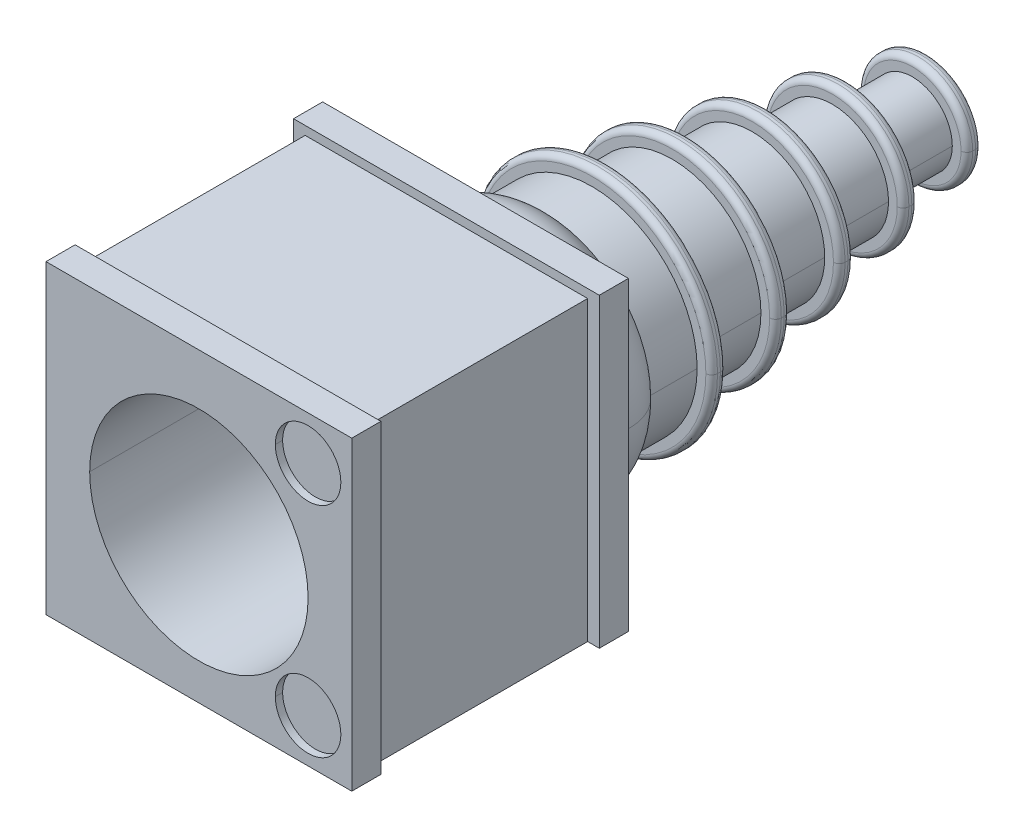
ISO-10303-21;
HEADER;
FILE_DESCRIPTION(('STEP AP214'),'2;1');
FILE_NAME('part.step','',(''),(''),'','','');
FILE_SCHEMA(('AUTOMOTIVE_DESIGN { 1 0 10303 214 1 1 1 1 }'));
ENDSEC;
DATA;
#1=APPLICATION_CONTEXT('core data for automotive mechanical design processes');
#2=APPLICATION_PROTOCOL_DEFINITION('international standard','automotive_design',2000,#1);
#3=PRODUCT_CONTEXT('',#1,'mechanical');
#4=PRODUCT('Part','Part','',(#3));
#5=PRODUCT_RELATED_PRODUCT_CATEGORY('part','',(#4));
#6=PRODUCT_DEFINITION_FORMATION('','',#4);
#7=PRODUCT_DEFINITION_CONTEXT('part definition',#1,'design');
#8=PRODUCT_DEFINITION('design','',#6,#7);
#9=PRODUCT_DEFINITION_SHAPE('','',#8);
#10=(LENGTH_UNIT() NAMED_UNIT(*) SI_UNIT(.MILLI.,.METRE.));
#11=(NAMED_UNIT(*) PLANE_ANGLE_UNIT() SI_UNIT($,.RADIAN.));
#12=(NAMED_UNIT(*) SI_UNIT($,.STERADIAN.) SOLID_ANGLE_UNIT());
#13=UNCERTAINTY_MEASURE_WITH_UNIT(LENGTH_MEASURE(1.E-05),#10,'distance_accuracy_value','');
#14=(GEOMETRIC_REPRESENTATION_CONTEXT(3) GLOBAL_UNCERTAINTY_ASSIGNED_CONTEXT((#13)) GLOBAL_UNIT_ASSIGNED_CONTEXT((#10,
#11,#12)) REPRESENTATION_CONTEXT('',''));
#15=CARTESIAN_POINT('',(0.,0.,0.));
#16=DIRECTION('',(0.,0.,1.));
#17=DIRECTION('',(1.,0.,0.));
#18=AXIS2_PLACEMENT_3D('',#15,#16,#17);
#19=CARTESIAN_POINT('',(0.,9.9063720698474,0.));
#20=DIRECTION('',(0.,1.,0.));
#21=DIRECTION('',(0.,0.,-1.));
#22=AXIS2_PLACEMENT_3D('',#19,#20,#21);
#23=PLANE('',#22);
#24=DIRECTION('',(-1.,0.,0.));
#25=VECTOR('',#24,1.);
#26=CARTESIAN_POINT('',(19.7,9.90637206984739,7.5));
#27=LINE('',#26,#25);
#28=CARTESIAN_POINT('',(20.2,9.90637206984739,7.5));
#29=VERTEX_POINT('',#28);
#30=CARTESIAN_POINT('',(0.8,9.90637206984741,7.5));
#31=VERTEX_POINT('',#30);
#32=EDGE_CURVE('E349',#29,#31,#27,.T.);
#33=ORIENTED_EDGE('',*,*,#32,.F.);
#34=DIRECTION('',(0.,0.,1.));
#35=VECTOR('',#34,1.);
#36=CARTESIAN_POINT('',(20.2,9.90637206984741,1.75));
#37=LINE('',#36,#35);
#38=CARTESIAN_POINT('',(20.2,9.90637206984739,-7.5));
#39=VERTEX_POINT('',#38);
#40=EDGE_CURVE('E694',#39,#29,#37,.T.);
#41=ORIENTED_EDGE('',*,*,#40,.F.);
#42=DIRECTION('',(1.,0.,0.));
#43=VECTOR('',#42,1.);
#44=CARTESIAN_POINT('',(1.3,9.90637206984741,-7.5));
#45=LINE('',#44,#43);
#46=CARTESIAN_POINT('',(0.8,9.90637206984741,-7.5));
#47=VERTEX_POINT('',#46);
#48=EDGE_CURVE('E232',#47,#39,#45,.T.);
#49=ORIENTED_EDGE('',*,*,#48,.F.);
#50=DIRECTION('',(0.,0.,-1.));
#51=VECTOR('',#50,1.);
#52=CARTESIAN_POINT('',(0.8,9.90637206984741,-3.5));
#53=LINE('',#52,#51);
#54=EDGE_CURVE('E701',#31,#47,#53,.T.);
#55=ORIENTED_EDGE('',*,*,#54,.F.);
#56=EDGE_LOOP('',(#33,#41,#49,#55));
#57=FACE_BOUND('',#56,.T.);
#58=ADVANCED_FACE('F15',(#57),#23,.T.);
#59=CARTESIAN_POINT('',(18.,7.5,9.));
#60=DIRECTION('',(0.,0.,1.));
#61=DIRECTION('',(1.,0.,0.));
#62=AXIS2_PLACEMENT_3D('',#59,#60,#61);
#63=PLANE('',#62);
#64=CARTESIAN_POINT('',(18.,7.5,9.));
#65=DIRECTION('',(0.,0.,1.));
#66=DIRECTION('',(1.,0.,0.));
#67=AXIS2_PLACEMENT_3D('',#64,#65,#66);
#68=CIRCLE('',#67,2.25);
#69=CARTESIAN_POINT('',(20.25,7.5,9.));
#70=VERTEX_POINT('',#69);
#71=CARTESIAN_POINT('',(15.75,7.5,9.));
#72=VERTEX_POINT('',#71);
#73=EDGE_CURVE('E9',#70,#72,#68,.T.);
#74=ORIENTED_EDGE('',*,*,#73,.T.);
#75=CARTESIAN_POINT('',(18.,7.5,9.));
#76=DIRECTION('',(0.,0.,1.));
#77=DIRECTION('',(1.,0.,0.));
#78=AXIS2_PLACEMENT_3D('',#75,#76,#77);
#79=CIRCLE('',#78,2.25);
#80=EDGE_CURVE('E894',#72,#70,#79,.T.);
#81=ORIENTED_EDGE('',*,*,#80,.T.);
#82=EDGE_LOOP('',(#74,#81));
#83=FACE_BOUND('',#82,.T.);
#84=ADVANCED_FACE('F1302',(#83),#63,.T.);
#85=CARTESIAN_POINT('',(18.,7.5,9.));
#86=DIRECTION('',(0.,0.,1.));
#87=DIRECTION('',(1.,0.,0.));
#88=AXIS2_PLACEMENT_3D('',#85,#86,#87);
#89=CYLINDRICAL_SURFACE('',#88,2.25);
#90=DIRECTION('',(0.,0.,1.));
#91=VECTOR('',#90,1.);
#92=CARTESIAN_POINT('',(15.75,7.5,9.));
#93=LINE('',#92,#91);
#94=CARTESIAN_POINT('',(15.75,7.5,9.5));
#95=VERTEX_POINT('',#94);
#96=EDGE_CURVE('E879',#72,#95,#93,.T.);
#97=ORIENTED_EDGE('',*,*,#96,.F.);
#98=ORIENTED_EDGE('',*,*,#73,.F.);
#99=DIRECTION('',(0.,0.,1.));
#100=VECTOR('',#99,1.);
#101=CARTESIAN_POINT('',(20.25,7.5,9.));
#102=LINE('',#101,#100);
#103=CARTESIAN_POINT('',(20.25,7.5,9.5));
#104=VERTEX_POINT('',#103);
#105=EDGE_CURVE('E150',#70,#104,#102,.T.);
#106=ORIENTED_EDGE('',*,*,#105,.T.);
#107=CARTESIAN_POINT('',(18.,7.5,9.5));
#108=DIRECTION('',(0.,0.,1.));
#109=DIRECTION('',(1.,0.,0.));
#110=AXIS2_PLACEMENT_3D('',#107,#108,#109);
#111=CIRCLE('',#110,2.25);
#112=EDGE_CURVE('E720',#104,#95,#111,.T.);
#113=ORIENTED_EDGE('',*,*,#112,.T.);
#114=EDGE_LOOP('',(#97,#98,#106,#113));
#115=FACE_BOUND('',#114,.T.);
#116=ADVANCED_FACE('F875',(#115),#89,.F.);
#117=CARTESIAN_POINT('',(18.,-7.5,9.));
#118=DIRECTION('',(0.,0.,1.));
#119=DIRECTION('',(1.,0.,0.));
#120=AXIS2_PLACEMENT_3D('',#117,#118,#119);
#121=PLANE('',#120);
#122=CARTESIAN_POINT('',(18.,-7.5,9.));
#123=DIRECTION('',(0.,0.,1.));
#124=DIRECTION('',(1.,0.,0.));
#125=AXIS2_PLACEMENT_3D('',#122,#123,#124);
#126=CIRCLE('',#125,2.25);
#127=CARTESIAN_POINT('',(20.25,-7.5,9.));
#128=VERTEX_POINT('',#127);
#129=CARTESIAN_POINT('',(15.75,-7.5,9.));
#130=VERTEX_POINT('',#129);
#131=EDGE_CURVE('E24',#128,#130,#126,.T.);
#132=ORIENTED_EDGE('',*,*,#131,.T.);
#133=CARTESIAN_POINT('',(18.,-7.5,9.));
#134=DIRECTION('',(0.,0.,1.));
#135=DIRECTION('',(1.,0.,0.));
#136=AXIS2_PLACEMENT_3D('',#133,#134,#135);
#137=CIRCLE('',#136,2.25);
#138=EDGE_CURVE('E128',#130,#128,#137,.T.);
#139=ORIENTED_EDGE('',*,*,#138,.T.);
#140=EDGE_LOOP('',(#132,#139));
#141=FACE_BOUND('',#140,.T.);
#142=ADVANCED_FACE('F17',(#141),#121,.T.);
#143=CARTESIAN_POINT('',(18.,-7.5,9.));
#144=DIRECTION('',(0.,0.,1.));
#145=DIRECTION('',(1.,0.,0.));
#146=AXIS2_PLACEMENT_3D('',#143,#144,#145);
#147=CYLINDRICAL_SURFACE('',#146,2.25);
#148=DIRECTION('',(0.,0.,1.));
#149=VECTOR('',#148,1.);
#150=CARTESIAN_POINT('',(15.75,-7.5,9.));
#151=LINE('',#150,#149);
#152=CARTESIAN_POINT('',(15.75,-7.5,9.5));
#153=VERTEX_POINT('',#152);
#154=EDGE_CURVE('E137',#130,#153,#151,.T.);
#155=ORIENTED_EDGE('',*,*,#154,.F.);
#156=ORIENTED_EDGE('',*,*,#131,.F.);
#157=DIRECTION('',(0.,0.,1.));
#158=VECTOR('',#157,1.);
#159=CARTESIAN_POINT('',(20.25,-7.5,9.));
#160=LINE('',#159,#158);
#161=CARTESIAN_POINT('',(20.25,-7.5,9.5));
#162=VERTEX_POINT('',#161);
#163=EDGE_CURVE('E148',#128,#162,#160,.T.);
#164=ORIENTED_EDGE('',*,*,#163,.T.);
#165=CARTESIAN_POINT('',(18.,-7.5,9.5));
#166=DIRECTION('',(0.,0.,1.));
#167=DIRECTION('',(1.,0.,0.));
#168=AXIS2_PLACEMENT_3D('',#165,#166,#167);
#169=CIRCLE('',#168,2.25);
#170=EDGE_CURVE('E97',#162,#153,#169,.T.);
#171=ORIENTED_EDGE('',*,*,#170,.T.);
#172=EDGE_LOOP('',(#155,#156,#164,#171));
#173=FACE_BOUND('',#172,.T.);
#174=ADVANCED_FACE('F138',(#173),#147,.F.);
#175=CARTESIAN_POINT('',(10.5,-0.5,-53.2135365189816));
#176=DIRECTION('',(0.,0.,-1.));
#177=DIRECTION('',(-1.,0.,0.));
#178=AXIS2_PLACEMENT_3D('',#175,#176,#177);
#179=CYLINDRICAL_SURFACE('',#178,7.22014572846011);
#180=DIRECTION('',(0.,0.,-1.));
#181=VECTOR('',#180,1.);
#182=CARTESIAN_POINT('',(17.7201457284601,-0.5,-53.2135365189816));
#183=LINE('',#182,#181);
#184=CARTESIAN_POINT('',(17.7201457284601,-0.5,-14.3));
#185=VERTEX_POINT('',#184);
#186=CARTESIAN_POINT('',(17.7201457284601,-0.5,-17.5));
#187=VERTEX_POINT('',#186);
#188=EDGE_CURVE('E199',#185,#187,#183,.T.);
#189=ORIENTED_EDGE('',*,*,#188,.F.);
#190=CARTESIAN_POINT('',(10.5,-0.5,-14.3));
#191=DIRECTION('',(0.,0.,-1.));
#192=DIRECTION('',(-1.,0.,0.));
#193=AXIS2_PLACEMENT_3D('',#190,#191,#192);
#194=CIRCLE('',#193,7.2201457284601);
#195=CARTESIAN_POINT('',(3.27985427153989,-0.5,-14.3));
#196=VERTEX_POINT('',#195);
#197=EDGE_CURVE('E115',#185,#196,#194,.T.);
#198=ORIENTED_EDGE('',*,*,#197,.T.);
#199=DIRECTION('',(0.,0.,-1.));
#200=VECTOR('',#199,1.);
#201=CARTESIAN_POINT('',(3.27985427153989,-0.5,-53.2135365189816));
#202=LINE('',#201,#200);
#203=CARTESIAN_POINT('',(3.27985427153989,-0.5,-17.5));
#204=VERTEX_POINT('',#203);
#205=EDGE_CURVE('E206',#196,#204,#202,.T.);
#206=ORIENTED_EDGE('',*,*,#205,.T.);
#207=CARTESIAN_POINT('',(10.5,-0.5,-17.5));
#208=DIRECTION('',(0.,0.,-1.));
#209=DIRECTION('',(1.,0.,0.));
#210=AXIS2_PLACEMENT_3D('',#207,#208,#209);
#211=CIRCLE('',#210,7.2201457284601);
#212=EDGE_CURVE('E654',#187,#204,#211,.T.);
#213=ORIENTED_EDGE('',*,*,#212,.F.);
#214=EDGE_LOOP('',(#189,#198,#206,#213));
#215=FACE_BOUND('',#214,.T.);
#216=ADVANCED_FACE('F932',(#215),#179,.T.);
#217=CARTESIAN_POINT('',(10.5,-0.5,-11.6477120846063));
#218=DIRECTION('',(0.,0.,-1.));
#219=DIRECTION('',(-1.,0.,0.));
#220=AXIS2_PLACEMENT_3D('',#217,#218,#219);
#221=TOROIDAL_SURFACE('',#220,4.93642752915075,3.5);
#222=CARTESIAN_POINT('',(15.4364275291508,-0.5,-11.6477120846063));
#223=DIRECTION('',(0.,1.,0.));
#224=DIRECTION('',(-1.,0.,0.));
#225=AXIS2_PLACEMENT_3D('',#222,#223,#224);
#226=CIRCLE('',#225,3.5);
#227=CARTESIAN_POINT('',(18.2,-0.5,-9.5));
#228=VERTEX_POINT('',#227);
#229=EDGE_CURVE('E167',#228,#185,#226,.T.);
#230=ORIENTED_EDGE('',*,*,#229,.F.);
#231=CARTESIAN_POINT('',(10.5,-0.5,-9.5));
#232=DIRECTION('',(0.,0.,-1.));
#233=DIRECTION('',(-1.,0.,0.));
#234=AXIS2_PLACEMENT_3D('',#231,#232,#233);
#235=CIRCLE('',#234,7.7);
#236=CARTESIAN_POINT('',(2.8,-0.5,-9.5));
#237=VERTEX_POINT('',#236);
#238=EDGE_CURVE('E72',#228,#237,#235,.T.);
#239=ORIENTED_EDGE('',*,*,#238,.T.);
#240=CARTESIAN_POINT('',(5.56357247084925,-0.5,-11.6477120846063));
#241=DIRECTION('',(0.,-1.,0.));
#242=DIRECTION('',(0.,0.,-1.));
#243=AXIS2_PLACEMENT_3D('',#240,#241,#242);
#244=CIRCLE('',#243,3.5);
#245=EDGE_CURVE('E171',#237,#196,#244,.T.);
#246=ORIENTED_EDGE('',*,*,#245,.T.);
#247=ORIENTED_EDGE('',*,*,#197,.F.);
#248=EDGE_LOOP('',(#230,#239,#246,#247));
#249=FACE_BOUND('',#248,.T.);
#250=ADVANCED_FACE('F1483',(#249),#221,.T.);
#251=CARTESIAN_POINT('',(0.,0.,-9.5));
#252=DIRECTION('',(0.,0.,-1.));
#253=DIRECTION('',(0.,-1.,0.));
#254=AXIS2_PLACEMENT_3D('',#251,#252,#253);
#255=PLANE('',#254);
#256=CARTESIAN_POINT('',(10.5,-0.5,-9.5));
#257=DIRECTION('',(0.,0.,-1.));
#258=DIRECTION('',(-1.,0.,0.));
#259=AXIS2_PLACEMENT_3D('',#256,#257,#258);
#260=CIRCLE('',#259,7.7);
#261=EDGE_CURVE('E172',#237,#228,#260,.T.);
#262=ORIENTED_EDGE('',*,*,#261,.F.);
#263=ORIENTED_EDGE('',*,*,#238,.F.);
#264=EDGE_LOOP('',(#262,#263));
#265=FACE_BOUND('',#264,.T.);
#266=DIRECTION('',(0.,-1.,0.));
#267=VECTOR('',#266,1.);
#268=CARTESIAN_POINT('',(0.,0.,-9.5));
#269=LINE('',#268,#267);
#270=CARTESIAN_POINT('',(0.,10.5,-9.5));
#271=VERTEX_POINT('',#270);
#272=CARTESIAN_POINT('',(0.,-10.5,-9.5));
#273=VERTEX_POINT('',#272);
#274=EDGE_CURVE('E35',#271,#273,#269,.T.);
#275=ORIENTED_EDGE('',*,*,#274,.F.);
#276=DIRECTION('',(-1.,0.,0.));
#277=VECTOR('',#276,1.);
#278=CARTESIAN_POINT('',(0.,10.5,-9.5));
#279=LINE('',#278,#277);
#280=CARTESIAN_POINT('',(21.,10.5,-9.5));
#281=VERTEX_POINT('',#280);
#282=EDGE_CURVE('E45',#281,#271,#279,.T.);
#283=ORIENTED_EDGE('',*,*,#282,.F.);
#284=DIRECTION('',(0.,-1.,0.));
#285=VECTOR('',#284,1.);
#286=CARTESIAN_POINT('',(21.,0.,-9.5));
#287=LINE('',#286,#285);
#288=CARTESIAN_POINT('',(21.,-10.5,-9.5));
#289=VERTEX_POINT('',#288);
#290=EDGE_CURVE('E78',#281,#289,#287,.T.);
#291=ORIENTED_EDGE('',*,*,#290,.T.);
#292=DIRECTION('',(-1.,0.,0.));
#293=VECTOR('',#292,1.);
#294=CARTESIAN_POINT('',(0.,-10.5,-9.5));
#295=LINE('',#294,#293);
#296=EDGE_CURVE('E75',#289,#273,#295,.T.);
#297=ORIENTED_EDGE('',*,*,#296,.T.);
#298=EDGE_LOOP('',(#275,#283,#291,#297));
#299=FACE_BOUND('',#298,.T.);
#300=ADVANCED_FACE('F76',(#265,#299),#255,.T.);
#301=CARTESIAN_POINT('',(0.,0.,9.5));
#302=DIRECTION('',(1.,0.,0.));
#303=DIRECTION('',(0.,1.,0.));
#304=AXIS2_PLACEMENT_3D('',#301,#302,#303);
#305=PLANE('',#304);
#306=DIRECTION('',(0.,0.,-1.));
#307=VECTOR('',#306,1.);
#308=CARTESIAN_POINT('',(0.,-10.5,9.5));
#309=LINE('',#308,#307);
#310=CARTESIAN_POINT('',(0.,-10.5,-7.5));
#311=VERTEX_POINT('',#310);
#312=EDGE_CURVE('E67',#311,#273,#309,.T.);
#313=ORIENTED_EDGE('',*,*,#312,.F.);
#314=DIRECTION('',(0.,1.,0.));
#315=VECTOR('',#314,1.);
#316=CARTESIAN_POINT('',(0.,0.,-7.5));
#317=LINE('',#316,#315);
#318=CARTESIAN_POINT('',(0.,10.5,-7.5));
#319=VERTEX_POINT('',#318);
#320=EDGE_CURVE('E251',#311,#319,#317,.T.);
#321=ORIENTED_EDGE('',*,*,#320,.T.);
#322=DIRECTION('',(0.,0.,-1.));
#323=VECTOR('',#322,1.);
#324=CARTESIAN_POINT('',(0.,10.5,9.5));
#325=LINE('',#324,#323);
#326=EDGE_CURVE('E70',#319,#271,#325,.T.);
#327=ORIENTED_EDGE('',*,*,#326,.T.);
#328=ORIENTED_EDGE('',*,*,#274,.T.);
#329=EDGE_LOOP('',(#313,#321,#327,#328));
#330=FACE_BOUND('',#329,.T.);
#331=ADVANCED_FACE('F63',(#330),#305,.F.);
#332=CARTESIAN_POINT('',(0.,10.5,9.5));
#333=DIRECTION('',(0.,-1.,0.));
#334=DIRECTION('',(0.,0.,-1.));
#335=AXIS2_PLACEMENT_3D('',#332,#333,#334);
#336=PLANE('',#335);
#337=DIRECTION('',(-1.,0.,0.));
#338=VECTOR('',#337,1.);
#339=CARTESIAN_POINT('',(0.,10.5,-7.5));
#340=LINE('',#339,#338);
#341=CARTESIAN_POINT('',(21.,10.5,-7.5));
#342=VERTEX_POINT('',#341);
#343=EDGE_CURVE('E254',#342,#319,#340,.T.);
#344=ORIENTED_EDGE('',*,*,#343,.F.);
#345=DIRECTION('',(0.,0.,-1.));
#346=VECTOR('',#345,1.);
#347=CARTESIAN_POINT('',(21.,10.5,9.5));
#348=LINE('',#347,#346);
#349=EDGE_CURVE('E105',#342,#281,#348,.T.);
#350=ORIENTED_EDGE('',*,*,#349,.T.);
#351=ORIENTED_EDGE('',*,*,#282,.T.);
#352=ORIENTED_EDGE('',*,*,#326,.F.);
#353=EDGE_LOOP('',(#344,#350,#351,#352));
#354=FACE_BOUND('',#353,.T.);
#355=ADVANCED_FACE('F1254',(#354),#336,.F.);
#356=CARTESIAN_POINT('',(21.,0.,9.5));
#357=DIRECTION('',(1.,0.,0.));
#358=DIRECTION('',(0.,1.,0.));
#359=AXIS2_PLACEMENT_3D('',#356,#357,#358);
#360=PLANE('',#359);
#361=DIRECTION('',(0.,1.,0.));
#362=VECTOR('',#361,1.);
#363=CARTESIAN_POINT('',(21.,-10.5,-7.5));
#364=LINE('',#363,#362);
#365=CARTESIAN_POINT('',(21.,-10.5,-7.5));
#366=VERTEX_POINT('',#365);
#367=EDGE_CURVE('E409',#366,#342,#364,.T.);
#368=ORIENTED_EDGE('',*,*,#367,.F.);
#369=DIRECTION('',(0.,0.,-1.));
#370=VECTOR('',#369,1.);
#371=CARTESIAN_POINT('',(21.,-10.5,9.5));
#372=LINE('',#371,#370);
#373=EDGE_CURVE('E83',#366,#289,#372,.T.);
#374=ORIENTED_EDGE('',*,*,#373,.T.);
#375=ORIENTED_EDGE('',*,*,#290,.F.);
#376=ORIENTED_EDGE('',*,*,#349,.F.);
#377=EDGE_LOOP('',(#368,#374,#375,#376));
#378=FACE_BOUND('',#377,.T.);
#379=ADVANCED_FACE('F1252',(#378),#360,.T.);
#380=CARTESIAN_POINT('',(0.,-10.5,9.5));
#381=DIRECTION('',(0.,-1.,0.));
#382=DIRECTION('',(0.,0.,-1.));
#383=AXIS2_PLACEMENT_3D('',#380,#381,#382);
#384=PLANE('',#383);
#385=DIRECTION('',(0.,0.,-1.));
#386=VECTOR('',#385,1.);
#387=CARTESIAN_POINT('',(20.2,-10.5,1.75));
#388=LINE('',#387,#386);
#389=CARTESIAN_POINT('',(20.2,-10.5,7.5));
#390=VERTEX_POINT('',#389);
#391=CARTESIAN_POINT('',(20.2,-10.5,-7.5));
#392=VERTEX_POINT('',#391);
#393=EDGE_CURVE('E690',#390,#392,#388,.T.);
#394=ORIENTED_EDGE('',*,*,#393,.F.);
#395=DIRECTION('',(-1.,0.,0.));
#396=VECTOR('',#395,1.);
#397=CARTESIAN_POINT('',(19.7,-10.5,7.5));
#398=LINE('',#397,#396);
#399=CARTESIAN_POINT('',(21.,-10.5,7.5));
#400=VERTEX_POINT('',#399);
#401=EDGE_CURVE('E237',#400,#390,#398,.T.);
#402=ORIENTED_EDGE('',*,*,#401,.F.);
#403=DIRECTION('',(0.,0.,-1.));
#404=VECTOR('',#403,1.);
#405=CARTESIAN_POINT('',(21.,-10.5,9.5));
#406=LINE('',#405,#404);
#407=CARTESIAN_POINT('',(21.,-10.5,9.5));
#408=VERTEX_POINT('',#407);
#409=EDGE_CURVE('E92',#408,#400,#406,.T.);
#410=ORIENTED_EDGE('',*,*,#409,.F.);
#411=DIRECTION('',(-1.,0.,0.));
#412=VECTOR('',#411,1.);
#413=CARTESIAN_POINT('',(0.,-10.5,9.5));
#414=LINE('',#413,#412);
#415=CARTESIAN_POINT('',(0.,-10.5,9.5));
#416=VERTEX_POINT('',#415);
#417=EDGE_CURVE('E713',#408,#416,#414,.T.);
#418=ORIENTED_EDGE('',*,*,#417,.T.);
#419=DIRECTION('',(0.,0.,-1.));
#420=VECTOR('',#419,1.);
#421=CARTESIAN_POINT('',(0.,-10.5,9.5));
#422=LINE('',#421,#420);
#423=CARTESIAN_POINT('',(0.,-10.5,7.5));
#424=VERTEX_POINT('',#423);
#425=EDGE_CURVE('E705',#416,#424,#422,.T.);
#426=ORIENTED_EDGE('',*,*,#425,.T.);
#427=DIRECTION('',(1.,0.,0.));
#428=VECTOR('',#427,1.);
#429=CARTESIAN_POINT('',(1.3,-10.5,7.5));
#430=LINE('',#429,#428);
#431=CARTESIAN_POINT('',(0.8,-10.5,7.5));
#432=VERTEX_POINT('',#431);
#433=EDGE_CURVE('E363',#424,#432,#430,.T.);
#434=ORIENTED_EDGE('',*,*,#433,.T.);
#435=DIRECTION('',(0.,0.,-1.));
#436=VECTOR('',#435,1.);
#437=CARTESIAN_POINT('',(0.8,-10.5,1.75));
#438=LINE('',#437,#436);
#439=CARTESIAN_POINT('',(0.8,-10.5,-7.5));
#440=VERTEX_POINT('',#439);
#441=EDGE_CURVE('E698',#432,#440,#438,.T.);
#442=ORIENTED_EDGE('',*,*,#441,.T.);
#443=DIRECTION('',(-1.,0.,0.));
#444=VECTOR('',#443,1.);
#445=CARTESIAN_POINT('',(0.,-10.5,-7.5));
#446=LINE('',#445,#444);
#447=EDGE_CURVE('E89',#440,#311,#446,.T.);
#448=ORIENTED_EDGE('',*,*,#447,.T.);
#449=ORIENTED_EDGE('',*,*,#312,.T.);
#450=ORIENTED_EDGE('',*,*,#296,.F.);
#451=ORIENTED_EDGE('',*,*,#373,.F.);
#452=DIRECTION('',(1.,0.,0.));
#453=VECTOR('',#452,1.);
#454=CARTESIAN_POINT('',(21.,-10.5,-7.5));
#455=LINE('',#454,#453);
#456=EDGE_CURVE('E517',#392,#366,#455,.T.);
#457=ORIENTED_EDGE('',*,*,#456,.F.);
#458=EDGE_LOOP('',(#394,#402,#410,#418,#426,#434,#442,#448,#449,#450,#451,#457));
#459=FACE_BOUND('',#458,.T.);
#460=ADVANCED_FACE('F86',(#459),#384,.T.);
#461=CARTESIAN_POINT('',(21.,0.,9.5));
#462=DIRECTION('',(1.,0.,0.));
#463=DIRECTION('',(0.,1.,0.));
#464=AXIS2_PLACEMENT_3D('',#461,#462,#463);
#465=PLANE('',#464);
#466=ORIENTED_EDGE('',*,*,#409,.T.);
#467=DIRECTION('',(0.,1.,0.));
#468=VECTOR('',#467,1.);
#469=CARTESIAN_POINT('',(21.,-10.5,7.5));
#470=LINE('',#469,#468);
#471=CARTESIAN_POINT('',(21.,10.5,7.5));
#472=VERTEX_POINT('',#471);
#473=EDGE_CURVE('E574',#400,#472,#470,.T.);
#474=ORIENTED_EDGE('',*,*,#473,.T.);
#475=DIRECTION('',(0.,0.,-1.));
#476=VECTOR('',#475,1.);
#477=CARTESIAN_POINT('',(21.,10.5,9.5));
#478=LINE('',#477,#476);
#479=CARTESIAN_POINT('',(21.,10.5,9.5));
#480=VERTEX_POINT('',#479);
#481=EDGE_CURVE('E678',#480,#472,#478,.T.);
#482=ORIENTED_EDGE('',*,*,#481,.F.);
#483=DIRECTION('',(0.,-1.,0.));
#484=VECTOR('',#483,1.);
#485=CARTESIAN_POINT('',(21.,0.,9.5));
#486=LINE('',#485,#484);
#487=EDGE_CURVE('E716',#480,#408,#486,.T.);
#488=ORIENTED_EDGE('',*,*,#487,.T.);
#489=EDGE_LOOP('',(#466,#474,#482,#488));
#490=FACE_BOUND('',#489,.T.);
#491=ADVANCED_FACE('F1287',(#490),#465,.T.);
#492=CARTESIAN_POINT('',(0.,0.,9.5));
#493=DIRECTION('',(0.,0.,-1.));
#494=DIRECTION('',(0.,-1.,0.));
#495=AXIS2_PLACEMENT_3D('',#492,#493,#494);
#496=PLANE('',#495);
#497=CARTESIAN_POINT('',(10.5,-0.5,9.5));
#498=DIRECTION('',(0.,0.,1.));
#499=DIRECTION('',(1.,0.,0.));
#500=AXIS2_PLACEMENT_3D('',#497,#498,#499);
#501=CIRCLE('',#500,7.5);
#502=CARTESIAN_POINT('',(18.,-0.5,9.5));
#503=VERTEX_POINT('',#502);
#504=CARTESIAN_POINT('',(3.,-0.5,9.5));
#505=VERTEX_POINT('',#504);
#506=EDGE_CURVE('E674',#503,#505,#501,.T.);
#507=ORIENTED_EDGE('',*,*,#506,.F.);
#508=CARTESIAN_POINT('',(10.5,-0.5,9.5));
#509=DIRECTION('',(0.,0.,1.));
#510=DIRECTION('',(1.,0.,0.));
#511=AXIS2_PLACEMENT_3D('',#508,#509,#510);
#512=CIRCLE('',#511,7.5);
#513=EDGE_CURVE('E231',#505,#503,#512,.T.);
#514=ORIENTED_EDGE('',*,*,#513,.F.);
#515=EDGE_LOOP('',(#507,#514));
#516=FACE_BOUND('',#515,.T.);
#517=ORIENTED_EDGE('',*,*,#170,.F.);
#518=CARTESIAN_POINT('',(18.,-7.5,9.5));
#519=DIRECTION('',(0.,0.,1.));
#520=DIRECTION('',(1.,0.,0.));
#521=AXIS2_PLACEMENT_3D('',#518,#519,#520);
#522=CIRCLE('',#521,2.25);
#523=EDGE_CURVE('E145',#153,#162,#522,.T.);
#524=ORIENTED_EDGE('',*,*,#523,.F.);
#525=EDGE_LOOP('',(#517,#524));
#526=FACE_BOUND('',#525,.T.);
#527=ORIENTED_EDGE('',*,*,#112,.F.);
#528=CARTESIAN_POINT('',(18.,7.5,9.5));
#529=DIRECTION('',(0.,0.,1.));
#530=DIRECTION('',(1.,0.,0.));
#531=AXIS2_PLACEMENT_3D('',#528,#529,#530);
#532=CIRCLE('',#531,2.25);
#533=EDGE_CURVE('E156',#95,#104,#532,.T.);
#534=ORIENTED_EDGE('',*,*,#533,.F.);
#535=EDGE_LOOP('',(#527,#534));
#536=FACE_BOUND('',#535,.T.);
#537=DIRECTION('',(0.,-1.,0.));
#538=VECTOR('',#537,1.);
#539=CARTESIAN_POINT('',(0.,0.,9.5));
#540=LINE('',#539,#538);
#541=CARTESIAN_POINT('',(0.,10.5,9.5));
#542=VERTEX_POINT('',#541);
#543=EDGE_CURVE('E709',#542,#416,#540,.T.);
#544=ORIENTED_EDGE('',*,*,#543,.T.);
#545=ORIENTED_EDGE('',*,*,#417,.F.);
#546=ORIENTED_EDGE('',*,*,#487,.F.);
#547=DIRECTION('',(-1.,0.,0.));
#548=VECTOR('',#547,1.);
#549=CARTESIAN_POINT('',(0.,10.5,9.5));
#550=LINE('',#549,#548);
#551=EDGE_CURVE('E686',#480,#542,#550,.T.);
#552=ORIENTED_EDGE('',*,*,#551,.T.);
#553=EDGE_LOOP('',(#544,#545,#546,#552));
#554=FACE_BOUND('',#553,.T.);
#555=ADVANCED_FACE('F887',(#516,#526,#536,#554),#496,.F.);
#556=CARTESIAN_POINT('',(0.,0.,9.5));
#557=DIRECTION('',(1.,0.,0.));
#558=DIRECTION('',(0.,1.,0.));
#559=AXIS2_PLACEMENT_3D('',#556,#557,#558);
#560=PLANE('',#559);
#561=DIRECTION('',(0.,1.,0.));
#562=VECTOR('',#561,1.);
#563=CARTESIAN_POINT('',(0.,0.,7.5));
#564=LINE('',#563,#562);
#565=CARTESIAN_POINT('',(0.,10.5,7.5));
#566=VERTEX_POINT('',#565);
#567=EDGE_CURVE('E367',#424,#566,#564,.T.);
#568=ORIENTED_EDGE('',*,*,#567,.F.);
#569=ORIENTED_EDGE('',*,*,#425,.F.);
#570=ORIENTED_EDGE('',*,*,#543,.F.);
#571=DIRECTION('',(0.,0.,-1.));
#572=VECTOR('',#571,1.);
#573=CARTESIAN_POINT('',(0.,10.5,9.5));
#574=LINE('',#573,#572);
#575=EDGE_CURVE('E682',#542,#566,#574,.T.);
#576=ORIENTED_EDGE('',*,*,#575,.T.);
#577=EDGE_LOOP('',(#568,#569,#570,#576));
#578=FACE_BOUND('',#577,.T.);
#579=ADVANCED_FACE('F1279',(#578),#560,.F.);
#580=CARTESIAN_POINT('',(0.8,0.,1.75));
#581=DIRECTION('',(1.,0.,0.));
#582=DIRECTION('',(0.,0.,-1.));
#583=AXIS2_PLACEMENT_3D('',#580,#581,#582);
#584=PLANE('',#583);
#585=ORIENTED_EDGE('',*,*,#441,.F.);
#586=DIRECTION('',(0.,1.,0.));
#587=VECTOR('',#586,1.);
#588=CARTESIAN_POINT('',(0.8,9.90637206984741,7.5));
#589=LINE('',#588,#587);
#590=EDGE_CURVE('E353',#432,#31,#589,.T.);
#591=ORIENTED_EDGE('',*,*,#590,.T.);
#592=ORIENTED_EDGE('',*,*,#54,.T.);
#593=DIRECTION('',(0.,-1.,0.));
#594=VECTOR('',#593,1.);
#595=CARTESIAN_POINT('',(0.8,9.90637206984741,-7.5));
#596=LINE('',#595,#594);
#597=EDGE_CURVE('E419',#47,#440,#596,.T.);
#598=ORIENTED_EDGE('',*,*,#597,.T.);
#599=EDGE_LOOP('',(#585,#591,#592,#598));
#600=FACE_BOUND('',#599,.T.);
#601=ADVANCED_FACE('F1272',(#600),#584,.F.);
#602=CARTESIAN_POINT('',(20.2,-10.5,-5.5));
#603=DIRECTION('',(1.,0.,0.));
#604=DIRECTION('',(0.,1.,0.));
#605=AXIS2_PLACEMENT_3D('',#602,#603,#604);
#606=PLANE('',#605);
#607=ORIENTED_EDGE('',*,*,#393,.T.);
#608=DIRECTION('',(0.,1.,0.));
#609=VECTOR('',#608,1.);
#610=CARTESIAN_POINT('',(20.2,9.90637206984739,-7.5));
#611=LINE('',#610,#609);
#612=EDGE_CURVE('E236',#392,#39,#611,.T.);
#613=ORIENTED_EDGE('',*,*,#612,.T.);
#614=ORIENTED_EDGE('',*,*,#40,.T.);
#615=DIRECTION('',(0.,-1.,0.));
#616=VECTOR('',#615,1.);
#617=CARTESIAN_POINT('',(20.2,9.90637206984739,7.5));
#618=LINE('',#617,#616);
#619=EDGE_CURVE('E354',#29,#390,#618,.T.);
#620=ORIENTED_EDGE('',*,*,#619,.T.);
#621=EDGE_LOOP('',(#607,#613,#614,#620));
#622=FACE_BOUND('',#621,.T.);
#623=ADVANCED_FACE('F1265',(#622),#606,.T.);
#624=CARTESIAN_POINT('',(0.,10.5,9.5));
#625=DIRECTION('',(0.,-1.,0.));
#626=DIRECTION('',(0.,0.,-1.));
#627=AXIS2_PLACEMENT_3D('',#624,#625,#626);
#628=PLANE('',#627);
#629=ORIENTED_EDGE('',*,*,#481,.T.);
#630=DIRECTION('',(1.,0.,0.));
#631=VECTOR('',#630,1.);
#632=CARTESIAN_POINT('',(1.3,10.5,7.5));
#633=LINE('',#632,#631);
#634=EDGE_CURVE('E503',#566,#472,#633,.T.);
#635=ORIENTED_EDGE('',*,*,#634,.F.);
#636=ORIENTED_EDGE('',*,*,#575,.F.);
#637=ORIENTED_EDGE('',*,*,#551,.F.);
#638=EDGE_LOOP('',(#629,#635,#636,#637));
#639=FACE_BOUND('',#638,.T.);
#640=ADVANCED_FACE('F1283',(#639),#628,.F.);
#641=CARTESIAN_POINT('',(10.5,-0.5,17.2551766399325));
#642=DIRECTION('',(0.,0.,1.));
#643=DIRECTION('',(1.,0.,0.));
#644=AXIS2_PLACEMENT_3D('',#641,#642,#643);
#645=CYLINDRICAL_SURFACE('',#644,7.5);
#646=DIRECTION('',(0.,0.,1.));
#647=VECTOR('',#646,1.);
#648=CARTESIAN_POINT('',(3.,-0.5,17.2551766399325));
#649=LINE('',#648,#647);
#650=CARTESIAN_POINT('',(3.,-0.5,-7.5));
#651=VERTEX_POINT('',#650);
#652=EDGE_CURVE('E221',#651,#505,#649,.T.);
#653=ORIENTED_EDGE('',*,*,#652,.F.);
#654=CARTESIAN_POINT('',(10.5,-0.5,-7.5));
#655=DIRECTION('',(0.,0.,1.));
#656=DIRECTION('',(1.,0.,0.));
#657=AXIS2_PLACEMENT_3D('',#654,#655,#656);
#658=CIRCLE('',#657,7.5);
#659=CARTESIAN_POINT('',(18.,-0.5,-7.5));
#660=VERTEX_POINT('',#659);
#661=EDGE_CURVE('E670',#660,#651,#658,.T.);
#662=ORIENTED_EDGE('',*,*,#661,.F.);
#663=DIRECTION('',(0.,0.,1.));
#664=VECTOR('',#663,1.);
#665=CARTESIAN_POINT('',(18.,-0.5,17.2551766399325));
#666=LINE('',#665,#664);
#667=EDGE_CURVE('E241',#660,#503,#666,.T.);
#668=ORIENTED_EDGE('',*,*,#667,.T.);
#669=ORIENTED_EDGE('',*,*,#506,.T.);
#670=EDGE_LOOP('',(#653,#662,#668,#669));
#671=FACE_BOUND('',#670,.T.);
#672=ADVANCED_FACE('F1425',(#671),#645,.F.);
#673=CARTESIAN_POINT('',(10.5,-0.5,-8.5));
#674=DIRECTION('',(0.,0.,1.));
#675=DIRECTION('',(1.,0.,0.));
#676=AXIS2_PLACEMENT_3D('',#673,#674,#675);
#677=CONICAL_SURFACE('',#676,6.5,0.785398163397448);
#678=DIRECTION('',(-0.707106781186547,0.,0.707106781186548));
#679=VECTOR('',#678,1.);
#680=CARTESIAN_POINT('',(4.,-0.5,-8.5));
#681=LINE('',#680,#679);
#682=CARTESIAN_POINT('',(4.,-0.5,-8.5));
#683=VERTEX_POINT('',#682);
#684=EDGE_CURVE('E261',#683,#651,#681,.T.);
#685=ORIENTED_EDGE('',*,*,#684,.F.);
#686=CARTESIAN_POINT('',(10.5,-0.5,-8.5));
#687=DIRECTION('',(0.,0.,1.));
#688=DIRECTION('',(1.,0.,0.));
#689=AXIS2_PLACEMENT_3D('',#686,#687,#688);
#690=CIRCLE('',#689,6.5);
#691=CARTESIAN_POINT('',(17.,-0.5,-8.5));
#692=VERTEX_POINT('',#691);
#693=EDGE_CURVE('E666',#692,#683,#690,.T.);
#694=ORIENTED_EDGE('',*,*,#693,.F.);
#695=DIRECTION('',(0.707106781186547,0.,0.707106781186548));
#696=VECTOR('',#695,1.);
#697=CARTESIAN_POINT('',(17.,-0.5,-8.5));
#698=LINE('',#697,#696);
#699=EDGE_CURVE('E265',#692,#660,#698,.T.);
#700=ORIENTED_EDGE('',*,*,#699,.T.);
#701=ORIENTED_EDGE('',*,*,#661,.T.);
#702=EDGE_LOOP('',(#685,#694,#700,#701));
#703=FACE_BOUND('',#702,.T.);
#704=ADVANCED_FACE('F1421',(#703),#677,.F.);
#705=CARTESIAN_POINT('',(10.5,-0.5,-27.8847763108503));
#706=DIRECTION('',(0.,0.,1.));
#707=DIRECTION('',(1.,0.,0.));
#708=AXIS2_PLACEMENT_3D('',#705,#706,#707);
#709=CYLINDRICAL_SURFACE('',#708,6.5);
#710=DIRECTION('',(0.,0.,1.));
#711=VECTOR('',#710,1.);
#712=CARTESIAN_POINT('',(4.,-0.5,-27.8847763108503));
#713=LINE('',#712,#711);
#714=CARTESIAN_POINT('',(4.,-0.5,-9.5));
#715=VERTEX_POINT('',#714);
#716=EDGE_CURVE('E279',#715,#683,#713,.T.);
#717=ORIENTED_EDGE('',*,*,#716,.F.);
#718=CARTESIAN_POINT('',(10.5,-0.5,-9.5));
#719=DIRECTION('',(0.,0.,1.));
#720=DIRECTION('',(-1.,0.,0.));
#721=AXIS2_PLACEMENT_3D('',#718,#719,#720);
#722=CIRCLE('',#721,6.5);
#723=CARTESIAN_POINT('',(17.,-0.5,-9.5));
#724=VERTEX_POINT('',#723);
#725=EDGE_CURVE('E662',#724,#715,#722,.T.);
#726=ORIENTED_EDGE('',*,*,#725,.F.);
#727=DIRECTION('',(0.,0.,1.));
#728=VECTOR('',#727,1.);
#729=CARTESIAN_POINT('',(17.,-0.5,-27.8847763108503));
#730=LINE('',#729,#728);
#731=EDGE_CURVE('E289',#724,#692,#730,.T.);
#732=ORIENTED_EDGE('',*,*,#731,.T.);
#733=ORIENTED_EDGE('',*,*,#693,.T.);
#734=EDGE_LOOP('',(#717,#726,#732,#733));
#735=FACE_BOUND('',#734,.T.);
#736=ADVANCED_FACE('F1418',(#735),#709,.F.);
#737=CARTESIAN_POINT('',(10.5,-0.5,-9.5));
#738=DIRECTION('',(0.,0.,1.));
#739=DIRECTION('',(1.,0.,0.));
#740=AXIS2_PLACEMENT_3D('',#737,#738,#739);
#741=CONICAL_SURFACE('',#740,6.5,0.200712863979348);
#742=DIRECTION('',(-0.199367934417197,0.,0.97992470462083));
#743=VECTOR('',#742,1.);
#744=CARTESIAN_POINT('',(4.,-0.5,-9.5));
#745=LINE('',#744,#743);
#746=CARTESIAN_POINT('',(10.0018428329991,-0.5,-39.));
#747=VERTEX_POINT('',#746);
#748=EDGE_CURVE('E301',#747,#715,#745,.T.);
#749=ORIENTED_EDGE('',*,*,#748,.F.);
#750=CARTESIAN_POINT('',(10.5,-0.5,-39.));
#751=DIRECTION('',(0.,0.,-1.));
#752=DIRECTION('',(-1.,0.,0.));
#753=AXIS2_PLACEMENT_3D('',#750,#751,#752);
#754=CIRCLE('',#753,0.498157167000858);
#755=CARTESIAN_POINT('',(10.9981571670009,-0.5,-39.));
#756=VERTEX_POINT('',#755);
#757=EDGE_CURVE('E658',#747,#756,#754,.T.);
#758=ORIENTED_EDGE('',*,*,#757,.T.);
#759=DIRECTION('',(0.199367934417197,0.,0.97992470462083));
#760=VECTOR('',#759,1.);
#761=CARTESIAN_POINT('',(17.,-0.5,-9.5));
#762=LINE('',#761,#760);
#763=EDGE_CURVE('E305',#756,#724,#762,.T.);
#764=ORIENTED_EDGE('',*,*,#763,.T.);
#765=ORIENTED_EDGE('',*,*,#725,.T.);
#766=EDGE_LOOP('',(#749,#758,#764,#765));
#767=FACE_BOUND('',#766,.T.);
#768=ADVANCED_FACE('F1416',(#767),#741,.F.);
#769=CARTESIAN_POINT('',(10.5,-0.5,-39.));
#770=DIRECTION('',(0.,0.,1.));
#771=DIRECTION('',(1.,0.,0.));
#772=AXIS2_PLACEMENT_3D('',#769,#770,#771);
#773=PLANE('',#772);
#774=CARTESIAN_POINT('',(10.5,-0.5,-39.));
#775=DIRECTION('',(0.,0.,-1.));
#776=DIRECTION('',(-1.,0.,0.));
#777=AXIS2_PLACEMENT_3D('',#774,#775,#776);
#778=CIRCLE('',#777,0.498157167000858);
#779=EDGE_CURVE('E293',#756,#747,#778,.T.);
#780=ORIENTED_EDGE('',*,*,#779,.F.);
#781=ORIENTED_EDGE('',*,*,#757,.F.);
#782=EDGE_LOOP('',(#780,#781));
#783=FACE_BOUND('',#782,.T.);
#784=ADVANCED_FACE('F1412',(#783),#773,.T.);
#785=CARTESIAN_POINT('',(18.3201457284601,-0.5,-17.5));
#786=DIRECTION('',(0.,0.,1.));
#787=DIRECTION('',(1.,0.,0.));
#788=AXIS2_PLACEMENT_3D('',#785,#786,#787);
#789=PLANE('',#788);
#790=CARTESIAN_POINT('',(10.5,-0.5,-17.5));
#791=DIRECTION('',(0.,0.,-1.));
#792=DIRECTION('',(1.,0.,0.));
#793=AXIS2_PLACEMENT_3D('',#790,#791,#792);
#794=CIRCLE('',#793,7.2201457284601);
#795=EDGE_CURVE('E210',#204,#187,#794,.T.);
#796=ORIENTED_EDGE('',*,*,#795,.T.);
#797=ORIENTED_EDGE('',*,*,#212,.T.);
#798=EDGE_LOOP('',(#796,#797));
#799=FACE_BOUND('',#798,.T.);
#800=CARTESIAN_POINT('',(10.5,-0.5,-17.5));
#801=DIRECTION('',(0.,0.,1.));
#802=DIRECTION('',(1.,0.,0.));
#803=AXIS2_PLACEMENT_3D('',#800,#801,#802);
#804=CIRCLE('',#803,7.82014572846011);
#805=CARTESIAN_POINT('',(18.3201457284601,-0.5,-17.5));
#806=VERTEX_POINT('',#805);
#807=CARTESIAN_POINT('',(2.67985427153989,-0.5,-17.5));
#808=VERTEX_POINT('',#807);
#809=EDGE_CURVE('E330',#806,#808,#804,.T.);
#810=ORIENTED_EDGE('',*,*,#809,.T.);
#811=CARTESIAN_POINT('',(10.5,-0.5,-17.5));
#812=DIRECTION('',(0.,0.,1.));
#813=DIRECTION('',(1.,0.,0.));
#814=AXIS2_PLACEMENT_3D('',#811,#812,#813);
#815=CIRCLE('',#814,7.82014572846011);
#816=EDGE_CURVE('E650',#808,#806,#815,.T.);
#817=ORIENTED_EDGE('',*,*,#816,.T.);
#818=EDGE_LOOP('',(#810,#817));
#819=FACE_BOUND('',#818,.T.);
#820=ADVANCED_FACE('F919',(#799,#819),#789,.T.);
#821=CARTESIAN_POINT('',(10.5,-0.5,-17.9));
#822=DIRECTION('',(0.,0.,1.));
#823=DIRECTION('',(1.,0.,0.));
#824=AXIS2_PLACEMENT_3D('',#821,#822,#823);
#825=TOROIDAL_SURFACE('',#824,7.82014572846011,0.4);
#826=CARTESIAN_POINT('',(2.67985427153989,-0.5,-17.9));
#827=DIRECTION('',(0.,1.,0.));
#828=DIRECTION('',(-1.,0.,0.));
#829=AXIS2_PLACEMENT_3D('',#826,#827,#828);
#830=CIRCLE('',#829,0.4);
#831=CARTESIAN_POINT('',(2.27985427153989,-0.5,-17.9));
#832=VERTEX_POINT('',#831);
#833=EDGE_CURVE('E326',#832,#808,#830,.T.);
#834=ORIENTED_EDGE('',*,*,#833,.F.);
#835=CARTESIAN_POINT('',(10.5,-0.5,-17.9));
#836=DIRECTION('',(0.,0.,1.));
#837=DIRECTION('',(1.,0.,0.));
#838=AXIS2_PLACEMENT_3D('',#835,#836,#837);
#839=CIRCLE('',#838,8.22014572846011);
#840=CARTESIAN_POINT('',(18.7201457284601,-0.5,-17.9));
#841=VERTEX_POINT('',#840);
#842=EDGE_CURVE('E646',#832,#841,#839,.T.);
#843=ORIENTED_EDGE('',*,*,#842,.T.);
#844=CARTESIAN_POINT('',(18.3201457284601,-0.5,-17.9));
#845=DIRECTION('',(0.,-1.,0.));
#846=DIRECTION('',(0.,0.,-1.));
#847=AXIS2_PLACEMENT_3D('',#844,#845,#846);
#848=CIRCLE('',#847,0.4);
#849=EDGE_CURVE('E336',#841,#806,#848,.T.);
#850=ORIENTED_EDGE('',*,*,#849,.T.);
#851=ORIENTED_EDGE('',*,*,#816,.F.);
#852=EDGE_LOOP('',(#834,#843,#850,#851));
#853=FACE_BOUND('',#852,.T.);
#854=ADVANCED_FACE('F1406',(#853),#825,.T.);
#855=CARTESIAN_POINT('',(10.5,-0.5,14.1102083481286));
#856=DIRECTION('',(0.,0.,1.));
#857=DIRECTION('',(1.,0.,0.));
#858=AXIS2_PLACEMENT_3D('',#855,#856,#857);
#859=CYLINDRICAL_SURFACE('',#858,8.22014572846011);
#860=DIRECTION('',(0.,0.,1.));
#861=VECTOR('',#860,1.);
#862=CARTESIAN_POINT('',(2.27985427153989,-0.5,14.1102083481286));
#863=LINE('',#862,#861);
#864=CARTESIAN_POINT('',(2.27985427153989,-0.5,-18.1));
#865=VERTEX_POINT('',#864);
#866=EDGE_CURVE('E335',#865,#832,#863,.T.);
#867=ORIENTED_EDGE('',*,*,#866,.F.);
#868=CARTESIAN_POINT('',(10.5,-0.5,-18.1));
#869=DIRECTION('',(0.,0.,1.));
#870=DIRECTION('',(1.,0.,0.));
#871=AXIS2_PLACEMENT_3D('',#868,#869,#870);
#872=CIRCLE('',#871,8.22014572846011);
#873=CARTESIAN_POINT('',(18.7201457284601,-0.5,-18.1));
#874=VERTEX_POINT('',#873);
#875=EDGE_CURVE('E642',#865,#874,#872,.T.);
#876=ORIENTED_EDGE('',*,*,#875,.T.);
#877=DIRECTION('',(0.,0.,1.));
#878=VECTOR('',#877,1.);
#879=CARTESIAN_POINT('',(18.7201457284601,-0.5,14.1102083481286));
#880=LINE('',#879,#878);
#881=EDGE_CURVE('E184',#874,#841,#880,.T.);
#882=ORIENTED_EDGE('',*,*,#881,.T.);
#883=ORIENTED_EDGE('',*,*,#842,.F.);
#884=EDGE_LOOP('',(#867,#876,#882,#883));
#885=FACE_BOUND('',#884,.T.);
#886=ADVANCED_FACE('F1403',(#885),#859,.T.);
#887=CARTESIAN_POINT('',(10.5,-0.5,-18.1));
#888=DIRECTION('',(0.,0.,1.));
#889=DIRECTION('',(1.,0.,0.));
#890=AXIS2_PLACEMENT_3D('',#887,#888,#889);
#891=TOROIDAL_SURFACE('',#890,7.82014572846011,0.4);
#892=CARTESIAN_POINT('',(2.67985427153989,-0.5,-18.1));
#893=DIRECTION('',(0.,1.,0.));
#894=DIRECTION('',(-1.,0.,0.));
#895=AXIS2_PLACEMENT_3D('',#892,#893,#894);
#896=CIRCLE('',#895,0.4);
#897=CARTESIAN_POINT('',(2.67985427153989,-0.5,-18.5));
#898=VERTEX_POINT('',#897);
#899=EDGE_CURVE('E183',#898,#865,#896,.T.);
#900=ORIENTED_EDGE('',*,*,#899,.F.);
#901=CARTESIAN_POINT('',(10.5,-0.5,-18.5));
#902=DIRECTION('',(0.,0.,1.));
#903=DIRECTION('',(1.,0.,0.));
#904=AXIS2_PLACEMENT_3D('',#901,#902,#903);
#905=CIRCLE('',#904,7.82014572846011);
#906=CARTESIAN_POINT('',(18.3201457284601,-0.5,-18.5));
#907=VERTEX_POINT('',#906);
#908=EDGE_CURVE('E634',#898,#907,#905,.T.);
#909=ORIENTED_EDGE('',*,*,#908,.T.);
#910=CARTESIAN_POINT('',(18.3201457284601,-0.5,-18.1));
#911=DIRECTION('',(0.,-1.,0.));
#912=DIRECTION('',(0.,0.,-1.));
#913=AXIS2_PLACEMENT_3D('',#910,#911,#912);
#914=CIRCLE('',#913,0.4);
#915=EDGE_CURVE('E358',#907,#874,#914,.T.);
#916=ORIENTED_EDGE('',*,*,#915,.T.);
#917=ORIENTED_EDGE('',*,*,#875,.F.);
#918=EDGE_LOOP('',(#900,#909,#916,#917));
#919=FACE_BOUND('',#918,.T.);
#920=ADVANCED_FACE('F1401',(#919),#891,.T.);
#921=CARTESIAN_POINT('',(10.5,-0.5,-53.2135365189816));
#922=DIRECTION('',(0.,0.,-1.));
#923=DIRECTION('',(-1.,0.,0.));
#924=AXIS2_PLACEMENT_3D('',#921,#922,#923);
#925=CYLINDRICAL_SURFACE('',#924,6.10115808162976);
#926=DIRECTION('',(0.,0.,-1.));
#927=VECTOR('',#926,1.);
#928=CARTESIAN_POINT('',(16.6011580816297,-0.5,-53.2135365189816));
#929=LINE('',#928,#927);
#930=CARTESIAN_POINT('',(16.6011580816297,-0.5,-18.5));
#931=VERTEX_POINT('',#930);
#932=CARTESIAN_POINT('',(16.6011580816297,-0.5,-23.));
#933=VERTEX_POINT('',#932);
#934=EDGE_CURVE('E205',#931,#933,#929,.T.);
#935=ORIENTED_EDGE('',*,*,#934,.F.);
#936=CARTESIAN_POINT('',(10.5,-0.5,-18.5));
#937=DIRECTION('',(0.,0.,-1.));
#938=DIRECTION('',(-1.,0.,0.));
#939=AXIS2_PLACEMENT_3D('',#936,#937,#938);
#940=CIRCLE('',#939,6.10115808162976);
#941=CARTESIAN_POINT('',(4.39884191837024,-0.5,-18.5));
#942=VERTEX_POINT('',#941);
#943=EDGE_CURVE('E638',#931,#942,#940,.T.);
#944=ORIENTED_EDGE('',*,*,#943,.T.);
#945=DIRECTION('',(0.,0.,-1.));
#946=VECTOR('',#945,1.);
#947=CARTESIAN_POINT('',(4.39884191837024,-0.5,-53.2135365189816));
#948=LINE('',#947,#946);
#949=CARTESIAN_POINT('',(4.39884191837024,-0.5,-23.));
#950=VERTEX_POINT('',#949);
#951=EDGE_CURVE('E204',#942,#950,#948,.T.);
#952=ORIENTED_EDGE('',*,*,#951,.T.);
#953=CARTESIAN_POINT('',(10.5,-0.5,-23.));
#954=DIRECTION('',(0.,0.,-1.));
#955=DIRECTION('',(1.,0.,0.));
#956=AXIS2_PLACEMENT_3D('',#953,#954,#955);
#957=CIRCLE('',#956,6.10115808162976);
#958=EDGE_CURVE('E630',#933,#950,#957,.T.);
#959=ORIENTED_EDGE('',*,*,#958,.F.);
#960=EDGE_LOOP('',(#935,#944,#952,#959));
#961=FACE_BOUND('',#960,.T.);
#962=ADVANCED_FACE('F1397',(#961),#925,.T.);
#963=CARTESIAN_POINT('',(3.27985427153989,-0.5,-18.5));
#964=DIRECTION('',(0.,0.,-1.));
#965=DIRECTION('',(0.,-1.,0.));
#966=AXIS2_PLACEMENT_3D('',#963,#964,#965);
#967=PLANE('',#966);
#968=CARTESIAN_POINT('',(10.5,-0.5,-18.5));
#969=DIRECTION('',(0.,0.,-1.));
#970=DIRECTION('',(-1.,0.,0.));
#971=AXIS2_PLACEMENT_3D('',#968,#969,#970);
#972=CIRCLE('',#971,6.10115808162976);
#973=EDGE_CURVE('E362',#942,#931,#972,.T.);
#974=ORIENTED_EDGE('',*,*,#973,.F.);
#975=ORIENTED_EDGE('',*,*,#943,.F.);
#976=EDGE_LOOP('',(#974,#975));
#977=FACE_BOUND('',#976,.T.);
#978=CARTESIAN_POINT('',(10.5,-0.5,-18.5));
#979=DIRECTION('',(0.,0.,1.));
#980=DIRECTION('',(1.,0.,0.));
#981=AXIS2_PLACEMENT_3D('',#978,#979,#980);
#982=CIRCLE('',#981,7.82014572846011);
#983=EDGE_CURVE('E179',#907,#898,#982,.T.);
#984=ORIENTED_EDGE('',*,*,#983,.F.);
#985=ORIENTED_EDGE('',*,*,#908,.F.);
#986=EDGE_LOOP('',(#984,#985));
#987=FACE_BOUND('',#986,.T.);
#988=ADVANCED_FACE('F1393',(#977,#987),#967,.T.);
#989=CARTESIAN_POINT('',(17.2011580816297,-0.5,-23.));
#990=DIRECTION('',(0.,0.,1.));
#991=DIRECTION('',(1.,0.,0.));
#992=AXIS2_PLACEMENT_3D('',#989,#990,#991);
#993=PLANE('',#992);
#994=CARTESIAN_POINT('',(10.5,-0.5,-23.));
#995=DIRECTION('',(0.,0.,-1.));
#996=DIRECTION('',(1.,0.,0.));
#997=AXIS2_PLACEMENT_3D('',#994,#995,#996);
#998=CIRCLE('',#997,6.10115808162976);
#999=EDGE_CURVE('E200',#950,#933,#998,.T.);
#1000=ORIENTED_EDGE('',*,*,#999,.T.);
#1001=ORIENTED_EDGE('',*,*,#958,.T.);
#1002=EDGE_LOOP('',(#1000,#1001));
#1003=FACE_BOUND('',#1002,.T.);
#1004=CARTESIAN_POINT('',(10.5,-0.5,-23.));
#1005=DIRECTION('',(0.,0.,1.));
#1006=DIRECTION('',(1.,0.,0.));
#1007=AXIS2_PLACEMENT_3D('',#1004,#1005,#1006);
#1008=CIRCLE('',#1007,6.70115808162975);
#1009=CARTESIAN_POINT('',(17.2011580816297,-0.5,-23.));
#1010=VERTEX_POINT('',#1009);
#1011=CARTESIAN_POINT('',(3.79884191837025,-0.5,-23.));
#1012=VERTEX_POINT('',#1011);
#1013=EDGE_CURVE('E394',#1010,#1012,#1008,.T.);
#1014=ORIENTED_EDGE('',*,*,#1013,.T.);
#1015=CARTESIAN_POINT('',(10.5,-0.5,-23.));
#1016=DIRECTION('',(0.,0.,1.));
#1017=DIRECTION('',(1.,0.,0.));
#1018=AXIS2_PLACEMENT_3D('',#1015,#1016,#1017);
#1019=CIRCLE('',#1018,6.70115808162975);
#1020=EDGE_CURVE('E626',#1012,#1010,#1019,.T.);
#1021=ORIENTED_EDGE('',*,*,#1020,.T.);
#1022=EDGE_LOOP('',(#1014,#1021));
#1023=FACE_BOUND('',#1022,.T.);
#1024=ADVANCED_FACE('F1389',(#1003,#1023),#993,.T.);
#1025=CARTESIAN_POINT('',(10.5,-0.5,-23.4));
#1026=DIRECTION('',(0.,0.,1.));
#1027=DIRECTION('',(1.,0.,0.));
#1028=AXIS2_PLACEMENT_3D('',#1025,#1026,#1027);
#1029=TOROIDAL_SURFACE('',#1028,6.70115808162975,0.4);
#1030=CARTESIAN_POINT('',(3.79884191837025,-0.5,-23.4));
#1031=DIRECTION('',(0.,1.,0.));
#1032=DIRECTION('',(-1.,0.,0.));
#1033=AXIS2_PLACEMENT_3D('',#1030,#1031,#1032);
#1034=CIRCLE('',#1033,0.4);
#1035=CARTESIAN_POINT('',(3.39884191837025,-0.5,-23.4));
#1036=VERTEX_POINT('',#1035);
#1037=EDGE_CURVE('E384',#1036,#1012,#1034,.T.);
#1038=ORIENTED_EDGE('',*,*,#1037,.F.);
#1039=CARTESIAN_POINT('',(10.5,-0.5,-23.4));
#1040=DIRECTION('',(0.,0.,1.));
#1041=DIRECTION('',(1.,0.,0.));
#1042=AXIS2_PLACEMENT_3D('',#1039,#1040,#1041);
#1043=CIRCLE('',#1042,7.10115808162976);
#1044=CARTESIAN_POINT('',(17.6011580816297,-0.5,-23.4));
#1045=VERTEX_POINT('',#1044);
#1046=EDGE_CURVE('E622',#1036,#1045,#1043,.T.);
#1047=ORIENTED_EDGE('',*,*,#1046,.T.);
#1048=CARTESIAN_POINT('',(17.2011580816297,-0.5,-23.4));
#1049=DIRECTION('',(0.,-1.,0.));
#1050=DIRECTION('',(0.,0.,-1.));
#1051=AXIS2_PLACEMENT_3D('',#1048,#1049,#1050);
#1052=CIRCLE('',#1051,0.400000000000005);
#1053=EDGE_CURVE('E401',#1045,#1010,#1052,.T.);
#1054=ORIENTED_EDGE('',*,*,#1053,.T.);
#1055=ORIENTED_EDGE('',*,*,#1020,.F.);
#1056=EDGE_LOOP('',(#1038,#1047,#1054,#1055));
#1057=FACE_BOUND('',#1056,.T.);
#1058=ADVANCED_FACE('F1386',(#1057),#1029,.T.);
#1059=CARTESIAN_POINT('',(10.5,-0.5,14.1102083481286));
#1060=DIRECTION('',(0.,0.,1.));
#1061=DIRECTION('',(1.,0.,0.));
#1062=AXIS2_PLACEMENT_3D('',#1059,#1060,#1061);
#1063=CYLINDRICAL_SURFACE('',#1062,7.10115808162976);
#1064=DIRECTION('',(0.,0.,1.));
#1065=VECTOR('',#1064,1.);
#1066=CARTESIAN_POINT('',(3.39884191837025,-0.5,14.1102083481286));
#1067=LINE('',#1066,#1065);
#1068=CARTESIAN_POINT('',(3.39884191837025,-0.5,-23.6));
#1069=VERTEX_POINT('',#1068);
#1070=EDGE_CURVE('E413',#1069,#1036,#1067,.T.);
#1071=ORIENTED_EDGE('',*,*,#1070,.F.);
#1072=CARTESIAN_POINT('',(10.5,-0.5,-23.6));
#1073=DIRECTION('',(0.,0.,1.));
#1074=DIRECTION('',(1.,0.,0.));
#1075=AXIS2_PLACEMENT_3D('',#1072,#1073,#1074);
#1076=CIRCLE('',#1075,7.10115808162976);
#1077=CARTESIAN_POINT('',(17.6011580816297,-0.5,-23.6));
#1078=VERTEX_POINT('',#1077);
#1079=EDGE_CURVE('E618',#1069,#1078,#1076,.T.);
#1080=ORIENTED_EDGE('',*,*,#1079,.T.);
#1081=DIRECTION('',(0.,0.,1.));
#1082=VECTOR('',#1081,1.);
#1083=CARTESIAN_POINT('',(17.6011580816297,-0.5,14.1102083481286));
#1084=LINE('',#1083,#1082);
#1085=EDGE_CURVE('E195',#1078,#1045,#1084,.T.);
#1086=ORIENTED_EDGE('',*,*,#1085,.T.);
#1087=ORIENTED_EDGE('',*,*,#1046,.F.);
#1088=EDGE_LOOP('',(#1071,#1080,#1086,#1087));
#1089=FACE_BOUND('',#1088,.T.);
#1090=ADVANCED_FACE('F1384',(#1089),#1063,.T.);
#1091=CARTESIAN_POINT('',(10.5,-0.5,-23.6));
#1092=DIRECTION('',(0.,0.,1.));
#1093=DIRECTION('',(1.,0.,0.));
#1094=AXIS2_PLACEMENT_3D('',#1091,#1092,#1093);
#1095=TOROIDAL_SURFACE('',#1094,6.70115808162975,0.4);
#1096=CARTESIAN_POINT('',(3.79884191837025,-0.5,-23.6));
#1097=DIRECTION('',(0.,1.,0.));
#1098=DIRECTION('',(-1.,0.,0.));
#1099=AXIS2_PLACEMENT_3D('',#1096,#1097,#1098);
#1100=CIRCLE('',#1099,0.4);
#1101=CARTESIAN_POINT('',(3.79884191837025,-0.5,-24.));
#1102=VERTEX_POINT('',#1101);
#1103=EDGE_CURVE('E194',#1102,#1069,#1100,.T.);
#1104=ORIENTED_EDGE('',*,*,#1103,.F.);
#1105=CARTESIAN_POINT('',(10.5,-0.5,-24.));
#1106=DIRECTION('',(0.,0.,1.));
#1107=DIRECTION('',(1.,0.,0.));
#1108=AXIS2_PLACEMENT_3D('',#1105,#1106,#1107);
#1109=CIRCLE('',#1108,6.70115808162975);
#1110=CARTESIAN_POINT('',(17.2011580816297,-0.5,-24.));
#1111=VERTEX_POINT('',#1110);
#1112=EDGE_CURVE('E270',#1102,#1111,#1109,.T.);
#1113=ORIENTED_EDGE('',*,*,#1112,.T.);
#1114=CARTESIAN_POINT('',(17.2011580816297,-0.5,-23.6));
#1115=DIRECTION('',(0.,-1.,0.));
#1116=DIRECTION('',(0.,0.,-1.));
#1117=AXIS2_PLACEMENT_3D('',#1114,#1115,#1116);
#1118=CIRCLE('',#1117,0.4);
#1119=EDGE_CURVE('E297',#1111,#1078,#1118,.T.);
#1120=ORIENTED_EDGE('',*,*,#1119,.T.);
#1121=ORIENTED_EDGE('',*,*,#1079,.F.);
#1122=EDGE_LOOP('',(#1104,#1113,#1120,#1121));
#1123=FACE_BOUND('',#1122,.T.);
#1124=ADVANCED_FACE('F1380',(#1123),#1095,.T.);
#1125=CARTESIAN_POINT('',(5.51782956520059,-0.5,-29.5));
#1126=DIRECTION('',(0.,0.,-1.));
#1127=DIRECTION('',(0.,-1.,0.));
#1128=AXIS2_PLACEMENT_3D('',#1125,#1126,#1127);
#1129=PLANE('',#1128);
#1130=CARTESIAN_POINT('',(10.5,-0.5,-29.5));
#1131=DIRECTION('',(0.,0.,-1.));
#1132=DIRECTION('',(-1.,0.,0.));
#1133=AXIS2_PLACEMENT_3D('',#1130,#1131,#1132);
#1134=CIRCLE('',#1133,3.86318278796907);
#1135=CARTESIAN_POINT('',(6.63681721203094,-0.5,-29.5));
#1136=VERTEX_POINT('',#1135);
#1137=CARTESIAN_POINT('',(14.3631827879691,-0.5,-29.5));
#1138=VERTEX_POINT('',#1137);
#1139=EDGE_CURVE('E311',#1136,#1138,#1134,.T.);
#1140=ORIENTED_EDGE('',*,*,#1139,.F.);
#1141=CARTESIAN_POINT('',(10.5,-0.5,-29.5));
#1142=DIRECTION('',(0.,0.,-1.));
#1143=DIRECTION('',(-1.,0.,0.));
#1144=AXIS2_PLACEMENT_3D('',#1141,#1142,#1143);
#1145=CIRCLE('',#1144,3.86318278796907);
#1146=EDGE_CURVE('E614',#1138,#1136,#1145,.T.);
#1147=ORIENTED_EDGE('',*,*,#1146,.F.);
#1148=EDGE_LOOP('',(#1140,#1147));
#1149=FACE_BOUND('',#1148,.T.);
#1150=CARTESIAN_POINT('',(10.5,-0.5,-29.5));
#1151=DIRECTION('',(0.,0.,1.));
#1152=DIRECTION('',(1.,0.,0.));
#1153=AXIS2_PLACEMENT_3D('',#1150,#1151,#1152);
#1154=CIRCLE('',#1153,5.58217043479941);
#1155=CARTESIAN_POINT('',(16.0821704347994,-0.5,-29.5));
#1156=VERTEX_POINT('',#1155);
#1157=CARTESIAN_POINT('',(4.9178295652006,-0.5,-29.5));
#1158=VERTEX_POINT('',#1157);
#1159=EDGE_CURVE('E166',#1156,#1158,#1154,.T.);
#1160=ORIENTED_EDGE('',*,*,#1159,.F.);
#1161=CARTESIAN_POINT('',(10.5,-0.5,-29.5));
#1162=DIRECTION('',(0.,0.,1.));
#1163=DIRECTION('',(1.,0.,0.));
#1164=AXIS2_PLACEMENT_3D('',#1161,#1162,#1163);
#1165=CIRCLE('',#1164,5.58217043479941);
#1166=EDGE_CURVE('E274',#1158,#1156,#1165,.T.);
#1167=ORIENTED_EDGE('',*,*,#1166,.F.);
#1168=EDGE_LOOP('',(#1160,#1167));
#1169=FACE_BOUND('',#1168,.T.);
#1170=ADVANCED_FACE('F1376',(#1149,#1169),#1129,.T.);
#1171=CARTESIAN_POINT('',(10.5,-0.5,-53.2135365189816));
#1172=DIRECTION('',(0.,0.,-1.));
#1173=DIRECTION('',(-1.,0.,0.));
#1174=AXIS2_PLACEMENT_3D('',#1171,#1172,#1173);
#1175=CYLINDRICAL_SURFACE('',#1174,3.86318278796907);
#1176=DIRECTION('',(0.,0.,-1.));
#1177=VECTOR('',#1176,1.);
#1178=CARTESIAN_POINT('',(14.3631827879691,-0.5,-53.2135365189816));
#1179=LINE('',#1178,#1177);
#1180=CARTESIAN_POINT('',(14.3631827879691,-0.5,-34.));
#1181=VERTEX_POINT('',#1180);
#1182=EDGE_CURVE('E315',#1138,#1181,#1179,.T.);
#1183=ORIENTED_EDGE('',*,*,#1182,.F.);
#1184=ORIENTED_EDGE('',*,*,#1146,.T.);
#1185=DIRECTION('',(0.,0.,-1.));
#1186=VECTOR('',#1185,1.);
#1187=CARTESIAN_POINT('',(6.63681721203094,-0.5,-53.2135365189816));
#1188=LINE('',#1187,#1186);
#1189=CARTESIAN_POINT('',(6.63681721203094,-0.5,-34.));
#1190=VERTEX_POINT('',#1189);
#1191=EDGE_CURVE('E280',#1136,#1190,#1188,.T.);
#1192=ORIENTED_EDGE('',*,*,#1191,.T.);
#1193=CARTESIAN_POINT('',(10.5,-0.5,-34.));
#1194=DIRECTION('',(0.,0.,-1.));
#1195=DIRECTION('',(1.,0.,0.));
#1196=AXIS2_PLACEMENT_3D('',#1193,#1194,#1195);
#1197=CIRCLE('',#1196,3.86318278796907);
#1198=EDGE_CURVE('E610',#1181,#1190,#1197,.T.);
#1199=ORIENTED_EDGE('',*,*,#1198,.F.);
#1200=EDGE_LOOP('',(#1183,#1184,#1192,#1199));
#1201=FACE_BOUND('',#1200,.T.);
#1202=ADVANCED_FACE('F1372',(#1201),#1175,.T.);
#1203=CARTESIAN_POINT('',(14.9631827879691,-0.5,-34.));
#1204=DIRECTION('',(0.,0.,1.));
#1205=DIRECTION('',(1.,0.,0.));
#1206=AXIS2_PLACEMENT_3D('',#1203,#1204,#1205);
#1207=PLANE('',#1206);
#1208=CARTESIAN_POINT('',(10.5,-0.5,-34.));
#1209=DIRECTION('',(0.,0.,-1.));
#1210=DIRECTION('',(1.,0.,0.));
#1211=AXIS2_PLACEMENT_3D('',#1208,#1209,#1210);
#1212=CIRCLE('',#1211,3.86318278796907);
#1213=EDGE_CURVE('E285',#1190,#1181,#1212,.T.);
#1214=ORIENTED_EDGE('',*,*,#1213,.T.);
#1215=ORIENTED_EDGE('',*,*,#1198,.T.);
#1216=EDGE_LOOP('',(#1214,#1215));
#1217=FACE_BOUND('',#1216,.T.);
#1218=CARTESIAN_POINT('',(10.5,-0.5,-34.));
#1219=DIRECTION('',(0.,0.,1.));
#1220=DIRECTION('',(1.,0.,0.));
#1221=AXIS2_PLACEMENT_3D('',#1218,#1219,#1220);
#1222=CIRCLE('',#1221,4.46318278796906);
#1223=CARTESIAN_POINT('',(14.9631827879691,-0.5,-34.));
#1224=VERTEX_POINT('',#1223);
#1225=CARTESIAN_POINT('',(6.03681721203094,-0.5,-34.));
#1226=VERTEX_POINT('',#1225);
#1227=EDGE_CURVE('E451',#1224,#1226,#1222,.T.);
#1228=ORIENTED_EDGE('',*,*,#1227,.T.);
#1229=CARTESIAN_POINT('',(10.5,-0.5,-34.));
#1230=DIRECTION('',(0.,0.,1.));
#1231=DIRECTION('',(1.,0.,0.));
#1232=AXIS2_PLACEMENT_3D('',#1229,#1230,#1231);
#1233=CIRCLE('',#1232,4.46318278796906);
#1234=EDGE_CURVE('E609',#1226,#1224,#1233,.T.);
#1235=ORIENTED_EDGE('',*,*,#1234,.T.);
#1236=EDGE_LOOP('',(#1228,#1235));
#1237=FACE_BOUND('',#1236,.T.);
#1238=ADVANCED_FACE('F1369',(#1217,#1237),#1207,.T.);
#1239=CARTESIAN_POINT('',(10.5,-0.5,-34.4));
#1240=DIRECTION('',(0.,0.,1.));
#1241=DIRECTION('',(1.,0.,0.));
#1242=AXIS2_PLACEMENT_3D('',#1239,#1240,#1241);
#1243=TOROIDAL_SURFACE('',#1242,4.46318278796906,0.4);
#1244=CARTESIAN_POINT('',(6.03681721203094,-0.5,-34.4));
#1245=DIRECTION('',(0.,1.,0.));
#1246=DIRECTION('',(-1.,0.,0.));
#1247=AXIS2_PLACEMENT_3D('',#1244,#1245,#1246);
#1248=CIRCLE('',#1247,0.4);
#1249=CARTESIAN_POINT('',(5.63681721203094,-0.5,-34.4));
#1250=VERTEX_POINT('',#1249);
#1251=EDGE_CURVE('E447',#1250,#1226,#1248,.T.);
#1252=ORIENTED_EDGE('',*,*,#1251,.F.);
#1253=CARTESIAN_POINT('',(10.5,-0.5,-34.4));
#1254=DIRECTION('',(0.,0.,1.));
#1255=DIRECTION('',(1.,0.,0.));
#1256=AXIS2_PLACEMENT_3D('',#1253,#1254,#1255);
#1257=CIRCLE('',#1256,4.86318278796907);
#1258=CARTESIAN_POINT('',(15.3631827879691,-0.5,-34.4));
#1259=VERTEX_POINT('',#1258);
#1260=EDGE_CURVE('E605',#1250,#1259,#1257,.T.);
#1261=ORIENTED_EDGE('',*,*,#1260,.T.);
#1262=CARTESIAN_POINT('',(14.9631827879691,-0.5,-34.4));
#1263=DIRECTION('',(0.,-1.,0.));
#1264=DIRECTION('',(0.,0.,-1.));
#1265=AXIS2_PLACEMENT_3D('',#1262,#1263,#1264);
#1266=CIRCLE('',#1265,0.4);
#1267=EDGE_CURVE('E178',#1259,#1224,#1266,.T.);
#1268=ORIENTED_EDGE('',*,*,#1267,.T.);
#1269=ORIENTED_EDGE('',*,*,#1234,.F.);
#1270=EDGE_LOOP('',(#1252,#1261,#1268,#1269));
#1271=FACE_BOUND('',#1270,.T.);
#1272=ADVANCED_FACE('F1365',(#1271),#1243,.T.);
#1273=CARTESIAN_POINT('',(10.5,-0.5,14.1102083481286));
#1274=DIRECTION('',(0.,0.,1.));
#1275=DIRECTION('',(1.,0.,0.));
#1276=AXIS2_PLACEMENT_3D('',#1273,#1274,#1275);
#1277=CYLINDRICAL_SURFACE('',#1276,4.86318278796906);
#1278=DIRECTION('',(0.,0.,1.));
#1279=VECTOR('',#1278,1.);
#1280=CARTESIAN_POINT('',(5.63681721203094,-0.5,14.1102083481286));
#1281=LINE('',#1280,#1279);
#1282=CARTESIAN_POINT('',(5.63681721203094,-0.5,-34.6));
#1283=VERTEX_POINT('',#1282);
#1284=EDGE_CURVE('E177',#1283,#1250,#1281,.T.);
#1285=ORIENTED_EDGE('',*,*,#1284,.F.);
#1286=CARTESIAN_POINT('',(10.5,-0.5,-34.6));
#1287=DIRECTION('',(0.,0.,1.));
#1288=DIRECTION('',(1.,0.,0.));
#1289=AXIS2_PLACEMENT_3D('',#1286,#1287,#1288);
#1290=CIRCLE('',#1289,4.86318278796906);
#1291=CARTESIAN_POINT('',(15.3631827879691,-0.5,-34.6));
#1292=VERTEX_POINT('',#1291);
#1293=EDGE_CURVE('E569',#1283,#1292,#1290,.T.);
#1294=ORIENTED_EDGE('',*,*,#1293,.T.);
#1295=DIRECTION('',(0.,0.,1.));
#1296=VECTOR('',#1295,1.);
#1297=CARTESIAN_POINT('',(15.3631827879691,-0.5,14.1102083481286));
#1298=LINE('',#1297,#1296);
#1299=EDGE_CURVE('E462',#1292,#1259,#1298,.T.);
#1300=ORIENTED_EDGE('',*,*,#1299,.T.);
#1301=ORIENTED_EDGE('',*,*,#1260,.F.);
#1302=EDGE_LOOP('',(#1285,#1294,#1300,#1301));
#1303=FACE_BOUND('',#1302,.T.);
#1304=ADVANCED_FACE('F1361',(#1303),#1277,.T.);
#1305=CARTESIAN_POINT('',(10.5,-0.5,-34.6));
#1306=DIRECTION('',(0.,0.,1.));
#1307=DIRECTION('',(1.,0.,0.));
#1308=AXIS2_PLACEMENT_3D('',#1305,#1306,#1307);
#1309=TOROIDAL_SURFACE('',#1308,4.46318278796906,0.4);
#1310=CARTESIAN_POINT('',(6.03681721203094,-0.5,-34.6));
#1311=DIRECTION('',(0.,1.,0.));
#1312=DIRECTION('',(-1.,0.,0.));
#1313=AXIS2_PLACEMENT_3D('',#1310,#1311,#1312);
#1314=CIRCLE('',#1313,0.4);
#1315=CARTESIAN_POINT('',(6.03681721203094,-0.5,-35.));
#1316=VERTEX_POINT('',#1315);
#1317=EDGE_CURVE('E482',#1316,#1283,#1314,.T.);
#1318=ORIENTED_EDGE('',*,*,#1317,.F.);
#1319=CARTESIAN_POINT('',(10.5,-0.5,-35.));
#1320=DIRECTION('',(0.,0.,1.));
#1321=DIRECTION('',(1.,0.,0.));
#1322=AXIS2_PLACEMENT_3D('',#1319,#1320,#1321);
#1323=CIRCLE('',#1322,4.46318278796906);
#1324=CARTESIAN_POINT('',(14.9631827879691,-0.5,-35.));
#1325=VERTEX_POINT('',#1324);
#1326=EDGE_CURVE('E565',#1316,#1325,#1323,.T.);
#1327=ORIENTED_EDGE('',*,*,#1326,.T.);
#1328=CARTESIAN_POINT('',(14.9631827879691,-0.5,-34.6));
#1329=DIRECTION('',(0.,-1.,0.));
#1330=DIRECTION('',(0.,0.,-1.));
#1331=AXIS2_PLACEMENT_3D('',#1328,#1329,#1330);
#1332=CIRCLE('',#1331,0.4);
#1333=EDGE_CURVE('E486',#1325,#1292,#1332,.T.);
#1334=ORIENTED_EDGE('',*,*,#1333,.T.);
#1335=ORIENTED_EDGE('',*,*,#1293,.F.);
#1336=EDGE_LOOP('',(#1318,#1327,#1334,#1335));
#1337=FACE_BOUND('',#1336,.T.);
#1338=ADVANCED_FACE('F1355',(#1337),#1309,.T.);
#1339=CARTESIAN_POINT('',(6.63681721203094,-0.5,-35.));
#1340=DIRECTION('',(0.,0.,-1.));
#1341=DIRECTION('',(0.,-1.,0.));
#1342=AXIS2_PLACEMENT_3D('',#1339,#1340,#1341);
#1343=PLANE('',#1342);
#1344=CARTESIAN_POINT('',(10.5,-0.5,-35.));
#1345=DIRECTION('',(0.,0.,-1.));
#1346=DIRECTION('',(-1.,0.,0.));
#1347=AXIS2_PLACEMENT_3D('',#1344,#1345,#1346);
#1348=CIRCLE('',#1347,2.74419514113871);
#1349=CARTESIAN_POINT('',(7.75580485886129,-0.5,-35.));
#1350=VERTEX_POINT('',#1349);
#1351=CARTESIAN_POINT('',(13.2441951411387,-0.5,-35.));
#1352=VERTEX_POINT('',#1351);
#1353=EDGE_CURVE('E490',#1350,#1352,#1348,.T.);
#1354=ORIENTED_EDGE('',*,*,#1353,.F.);
#1355=CARTESIAN_POINT('',(10.5,-0.5,-35.));
#1356=DIRECTION('',(0.,0.,-1.));
#1357=DIRECTION('',(-1.,0.,0.));
#1358=AXIS2_PLACEMENT_3D('',#1355,#1356,#1357);
#1359=CIRCLE('',#1358,2.74419514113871);
#1360=EDGE_CURVE('E570',#1352,#1350,#1359,.T.);
#1361=ORIENTED_EDGE('',*,*,#1360,.F.);
#1362=EDGE_LOOP('',(#1354,#1361));
#1363=FACE_BOUND('',#1362,.T.);
#1364=CARTESIAN_POINT('',(10.5,-0.5,-35.));
#1365=DIRECTION('',(0.,0.,1.));
#1366=DIRECTION('',(1.,0.,0.));
#1367=AXIS2_PLACEMENT_3D('',#1364,#1365,#1366);
#1368=CIRCLE('',#1367,4.46318278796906);
#1369=EDGE_CURVE('E472',#1325,#1316,#1368,.T.);
#1370=ORIENTED_EDGE('',*,*,#1369,.F.);
#1371=ORIENTED_EDGE('',*,*,#1326,.F.);
#1372=EDGE_LOOP('',(#1370,#1371));
#1373=FACE_BOUND('',#1372,.T.);
#1374=ADVANCED_FACE('F1351',(#1363,#1373),#1343,.T.);
#1375=CARTESIAN_POINT('',(10.5,-0.5,-53.2135365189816));
#1376=DIRECTION('',(0.,0.,-1.));
#1377=DIRECTION('',(-1.,0.,0.));
#1378=AXIS2_PLACEMENT_3D('',#1375,#1376,#1377);
#1379=CYLINDRICAL_SURFACE('',#1378,2.74419514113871);
#1380=DIRECTION('',(0.,0.,-1.));
#1381=VECTOR('',#1380,1.);
#1382=CARTESIAN_POINT('',(13.2441951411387,-0.5,-53.2135365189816));
#1383=LINE('',#1382,#1381);
#1384=CARTESIAN_POINT('',(13.2441951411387,-0.5,-39.5));
#1385=VERTEX_POINT('',#1384);
#1386=EDGE_CURVE('E373',#1352,#1385,#1383,.T.);
#1387=ORIENTED_EDGE('',*,*,#1386,.F.);
#1388=ORIENTED_EDGE('',*,*,#1360,.T.);
#1389=DIRECTION('',(0.,0.,-1.));
#1390=VECTOR('',#1389,1.);
#1391=CARTESIAN_POINT('',(7.75580485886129,-0.5,-53.2135365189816));
#1392=LINE('',#1391,#1390);
#1393=CARTESIAN_POINT('',(7.75580485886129,-0.5,-39.5));
#1394=VERTEX_POINT('',#1393);
#1395=EDGE_CURVE('E372',#1350,#1394,#1392,.T.);
#1396=ORIENTED_EDGE('',*,*,#1395,.T.);
#1397=CARTESIAN_POINT('',(10.5,-0.5,-39.5));
#1398=DIRECTION('',(0.,0.,-1.));
#1399=DIRECTION('',(1.,0.,0.));
#1400=AXIS2_PLACEMENT_3D('',#1397,#1398,#1399);
#1401=CIRCLE('',#1400,2.74419514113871);
#1402=EDGE_CURVE('E159',#1385,#1394,#1401,.T.);
#1403=ORIENTED_EDGE('',*,*,#1402,.F.);
#1404=EDGE_LOOP('',(#1387,#1388,#1396,#1403));
#1405=FACE_BOUND('',#1404,.T.);
#1406=ADVANCED_FACE('F1348',(#1405),#1379,.T.);
#1407=CARTESIAN_POINT('',(13.8441951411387,-0.5,-39.5));
#1408=DIRECTION('',(0.,0.,1.));
#1409=DIRECTION('',(1.,0.,0.));
#1410=AXIS2_PLACEMENT_3D('',#1407,#1408,#1409);
#1411=PLANE('',#1410);
#1412=CARTESIAN_POINT('',(10.5,-0.5,-39.5));
#1413=DIRECTION('',(0.,0.,-1.));
#1414=DIRECTION('',(1.,0.,0.));
#1415=AXIS2_PLACEMENT_3D('',#1412,#1413,#1414);
#1416=CIRCLE('',#1415,2.74419514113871);
#1417=EDGE_CURVE('E368',#1394,#1385,#1416,.T.);
#1418=ORIENTED_EDGE('',*,*,#1417,.T.);
#1419=ORIENTED_EDGE('',*,*,#1402,.T.);
#1420=EDGE_LOOP('',(#1418,#1419));
#1421=FACE_BOUND('',#1420,.T.);
#1422=CARTESIAN_POINT('',(10.5,-0.5,-39.5));
#1423=DIRECTION('',(0.,0.,1.));
#1424=DIRECTION('',(1.,0.,0.));
#1425=AXIS2_PLACEMENT_3D('',#1422,#1423,#1424);
#1426=CIRCLE('',#1425,3.34419514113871);
#1427=CARTESIAN_POINT('',(13.8441951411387,-0.5,-39.5));
#1428=VERTEX_POINT('',#1427);
#1429=CARTESIAN_POINT('',(7.15580485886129,-0.5,-39.5));
#1430=VERTEX_POINT('',#1429);
#1431=EDGE_CURVE('E385',#1428,#1430,#1426,.T.);
#1432=ORIENTED_EDGE('',*,*,#1431,.T.);
#1433=CARTESIAN_POINT('',(10.5,-0.5,-39.5));
#1434=DIRECTION('',(0.,0.,1.));
#1435=DIRECTION('',(1.,0.,0.));
#1436=AXIS2_PLACEMENT_3D('',#1433,#1434,#1435);
#1437=CIRCLE('',#1436,3.34419514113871);
#1438=EDGE_CURVE('E467',#1430,#1428,#1437,.T.);
#1439=ORIENTED_EDGE('',*,*,#1438,.T.);
#1440=EDGE_LOOP('',(#1432,#1439));
#1441=FACE_BOUND('',#1440,.T.);
#1442=ADVANCED_FACE('F1346',(#1421,#1441),#1411,.T.);
#1443=CARTESIAN_POINT('',(10.5,-0.5,-39.9));
#1444=DIRECTION('',(0.,0.,1.));
#1445=DIRECTION('',(1.,0.,0.));
#1446=AXIS2_PLACEMENT_3D('',#1443,#1444,#1445);
#1447=TOROIDAL_SURFACE('',#1446,3.34419514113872,0.4);
#1448=CARTESIAN_POINT('',(7.15580485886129,-0.5,-39.9));
#1449=DIRECTION('',(0.,1.,0.));
#1450=DIRECTION('',(-1.,0.,0.));
#1451=AXIS2_PLACEMENT_3D('',#1448,#1449,#1450);
#1452=CIRCLE('',#1451,0.4);
#1453=CARTESIAN_POINT('',(6.75580485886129,-0.5,-39.9));
#1454=VERTEX_POINT('',#1453);
#1455=EDGE_CURVE('E390',#1454,#1430,#1452,.T.);
#1456=ORIENTED_EDGE('',*,*,#1455,.F.);
#1457=CARTESIAN_POINT('',(10.5,-0.5,-39.9));
#1458=DIRECTION('',(0.,0.,1.));
#1459=DIRECTION('',(1.,0.,0.));
#1460=AXIS2_PLACEMENT_3D('',#1457,#1458,#1459);
#1461=CIRCLE('',#1460,3.74419514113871);
#1462=CARTESIAN_POINT('',(14.2441951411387,-0.5,-39.9));
#1463=VERTEX_POINT('',#1462);
#1464=EDGE_CURVE('E463',#1454,#1463,#1461,.T.);
#1465=ORIENTED_EDGE('',*,*,#1464,.T.);
#1466=CARTESIAN_POINT('',(13.8441951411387,-0.5,-39.9));
#1467=DIRECTION('',(0.,-1.,0.));
#1468=DIRECTION('',(0.,0.,-1.));
#1469=AXIS2_PLACEMENT_3D('',#1466,#1467,#1468);
#1470=CIRCLE('',#1469,0.4);
#1471=EDGE_CURVE('E389',#1463,#1428,#1470,.T.);
#1472=ORIENTED_EDGE('',*,*,#1471,.T.);
#1473=ORIENTED_EDGE('',*,*,#1438,.F.);
#1474=EDGE_LOOP('',(#1456,#1465,#1472,#1473));
#1475=FACE_BOUND('',#1474,.T.);
#1476=ADVANCED_FACE('F1343',(#1475),#1447,.T.);
#1477=CARTESIAN_POINT('',(10.5,-0.5,14.1102083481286));
#1478=DIRECTION('',(0.,0.,1.));
#1479=DIRECTION('',(1.,0.,0.));
#1480=AXIS2_PLACEMENT_3D('',#1477,#1478,#1479);
#1481=CYLINDRICAL_SURFACE('',#1480,3.74419514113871);
#1482=DIRECTION('',(0.,0.,1.));
#1483=VECTOR('',#1482,1.);
#1484=CARTESIAN_POINT('',(6.75580485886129,-0.5,14.1102083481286));
#1485=LINE('',#1484,#1483);
#1486=CARTESIAN_POINT('',(6.75580485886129,-0.5,-40.1));
#1487=VERTEX_POINT('',#1486);
#1488=EDGE_CURVE('E222',#1487,#1454,#1485,.T.);
#1489=ORIENTED_EDGE('',*,*,#1488,.F.);
#1490=CARTESIAN_POINT('',(10.5,-0.5,-40.1));
#1491=DIRECTION('',(0.,0.,1.));
#1492=DIRECTION('',(1.,0.,0.));
#1493=AXIS2_PLACEMENT_3D('',#1490,#1491,#1492);
#1494=CIRCLE('',#1493,3.74419514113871);
#1495=CARTESIAN_POINT('',(14.2441951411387,-0.5,-40.1));
#1496=VERTEX_POINT('',#1495);
#1497=EDGE_CURVE('E468',#1487,#1496,#1494,.T.);
#1498=ORIENTED_EDGE('',*,*,#1497,.T.);
#1499=DIRECTION('',(0.,0.,1.));
#1500=VECTOR('',#1499,1.);
#1501=CARTESIAN_POINT('',(14.2441951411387,-0.5,14.1102083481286));
#1502=LINE('',#1501,#1500);
#1503=EDGE_CURVE('E226',#1496,#1463,#1502,.T.);
#1504=ORIENTED_EDGE('',*,*,#1503,.T.);
#1505=ORIENTED_EDGE('',*,*,#1464,.F.);
#1506=EDGE_LOOP('',(#1489,#1498,#1504,#1505));
#1507=FACE_BOUND('',#1506,.T.);
#1508=ADVANCED_FACE('F1341',(#1507),#1481,.T.);
#1509=CARTESIAN_POINT('',(10.5,-0.5,-40.1));
#1510=DIRECTION('',(0.,0.,1.));
#1511=DIRECTION('',(1.,0.,0.));
#1512=AXIS2_PLACEMENT_3D('',#1509,#1510,#1511);
#1513=TOROIDAL_SURFACE('',#1512,3.34419514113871,0.4);
#1514=CARTESIAN_POINT('',(7.15580485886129,-0.5,-40.1));
#1515=DIRECTION('',(0.,1.,0.));
#1516=DIRECTION('',(-1.,0.,0.));
#1517=AXIS2_PLACEMENT_3D('',#1514,#1515,#1516);
#1518=CIRCLE('',#1517,0.4);
#1519=CARTESIAN_POINT('',(7.15580485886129,-0.5,-40.5));
#1520=VERTEX_POINT('',#1519);
#1521=EDGE_CURVE('E246',#1520,#1487,#1518,.T.);
#1522=ORIENTED_EDGE('',*,*,#1521,.F.);
#1523=CARTESIAN_POINT('',(10.5,-0.5,-40.5));
#1524=DIRECTION('',(0.,0.,1.));
#1525=DIRECTION('',(1.,0.,0.));
#1526=AXIS2_PLACEMENT_3D('',#1523,#1524,#1525);
#1527=CIRCLE('',#1526,3.34419514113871);
#1528=CARTESIAN_POINT('',(13.8441951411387,-0.5,-40.5));
#1529=VERTEX_POINT('',#1528);
#1530=EDGE_CURVE('E555',#1520,#1529,#1527,.T.);
#1531=ORIENTED_EDGE('',*,*,#1530,.T.);
#1532=CARTESIAN_POINT('',(13.8441951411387,-0.5,-40.1));
#1533=DIRECTION('',(0.,-1.,0.));
#1534=DIRECTION('',(0.,0.,-1.));
#1535=AXIS2_PLACEMENT_3D('',#1532,#1533,#1534);
#1536=CIRCLE('',#1535,0.4);
#1537=EDGE_CURVE('E524',#1529,#1496,#1536,.T.);
#1538=ORIENTED_EDGE('',*,*,#1537,.T.);
#1539=ORIENTED_EDGE('',*,*,#1497,.F.);
#1540=EDGE_LOOP('',(#1522,#1531,#1538,#1539));
#1541=FACE_BOUND('',#1540,.T.);
#1542=ADVANCED_FACE('F1338',(#1541),#1513,.T.);
#1543=CARTESIAN_POINT('',(7.75580485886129,-0.5,-40.5));
#1544=DIRECTION('',(0.,0.,-1.));
#1545=DIRECTION('',(0.,-1.,0.));
#1546=AXIS2_PLACEMENT_3D('',#1543,#1544,#1545);
#1547=PLANE('',#1546);
#1548=CARTESIAN_POINT('',(10.5,-0.5,-40.5));
#1549=DIRECTION('',(0.,0.,1.));
#1550=DIRECTION('',(1.,0.,0.));
#1551=AXIS2_PLACEMENT_3D('',#1548,#1549,#1550);
#1552=CIRCLE('',#1551,3.34419514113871);
#1553=EDGE_CURVE('E242',#1529,#1520,#1552,.T.);
#1554=ORIENTED_EDGE('',*,*,#1553,.F.);
#1555=ORIENTED_EDGE('',*,*,#1530,.F.);
#1556=EDGE_LOOP('',(#1554,#1555));
#1557=FACE_BOUND('',#1556,.T.);
#1558=ADVANCED_FACE('F1336',(#1557),#1547,.T.);
#1559=CARTESIAN_POINT('',(16.0821704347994,-0.5,-28.5));
#1560=DIRECTION('',(0.,0.,1.));
#1561=DIRECTION('',(1.,0.,0.));
#1562=AXIS2_PLACEMENT_3D('',#1559,#1560,#1561);
#1563=PLANE('',#1562);
#1564=CARTESIAN_POINT('',(10.5,-0.5,-28.5));
#1565=DIRECTION('',(0.,0.,-1.));
#1566=DIRECTION('',(1.,0.,0.));
#1567=AXIS2_PLACEMENT_3D('',#1564,#1565,#1566);
#1568=CIRCLE('',#1567,4.98217043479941);
#1569=CARTESIAN_POINT('',(5.51782956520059,-0.5,-28.5));
#1570=VERTEX_POINT('',#1569);
#1571=CARTESIAN_POINT('',(15.4821704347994,-0.5,-28.5));
#1572=VERTEX_POINT('',#1571);
#1573=EDGE_CURVE('E473',#1570,#1572,#1568,.T.);
#1574=ORIENTED_EDGE('',*,*,#1573,.T.);
#1575=CARTESIAN_POINT('',(10.5,-0.5,-28.5));
#1576=DIRECTION('',(0.,0.,-1.));
#1577=DIRECTION('',(1.,0.,0.));
#1578=AXIS2_PLACEMENT_3D('',#1575,#1576,#1577);
#1579=CIRCLE('',#1578,4.98217043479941);
#1580=EDGE_CURVE('E275',#1572,#1570,#1579,.T.);
#1581=ORIENTED_EDGE('',*,*,#1580,.T.);
#1582=EDGE_LOOP('',(#1574,#1581));
#1583=FACE_BOUND('',#1582,.T.);
#1584=CARTESIAN_POINT('',(10.5,-0.5,-28.5));
#1585=DIRECTION('',(0.,0.,1.));
#1586=DIRECTION('',(1.,0.,0.));
#1587=AXIS2_PLACEMENT_3D('',#1584,#1585,#1586);
#1588=CIRCLE('',#1587,5.58217043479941);
#1589=CARTESIAN_POINT('',(16.0821704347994,-0.5,-28.5));
#1590=VERTEX_POINT('',#1589);
#1591=CARTESIAN_POINT('',(4.9178295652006,-0.5,-28.5));
#1592=VERTEX_POINT('',#1591);
#1593=EDGE_CURVE('E347',#1590,#1592,#1588,.T.);
#1594=ORIENTED_EDGE('',*,*,#1593,.T.);
#1595=CARTESIAN_POINT('',(10.5,-0.5,-28.5));
#1596=DIRECTION('',(0.,0.,1.));
#1597=DIRECTION('',(1.,0.,0.));
#1598=AXIS2_PLACEMENT_3D('',#1595,#1596,#1597);
#1599=CIRCLE('',#1598,5.58217043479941);
#1600=EDGE_CURVE('E538',#1592,#1590,#1599,.T.);
#1601=ORIENTED_EDGE('',*,*,#1600,.T.);
#1602=EDGE_LOOP('',(#1594,#1601));
#1603=FACE_BOUND('',#1602,.T.);
#1604=ADVANCED_FACE('F1332',(#1583,#1603),#1563,.T.);
#1605=CARTESIAN_POINT('',(10.5,-0.5,-28.9));
#1606=DIRECTION('',(0.,0.,1.));
#1607=DIRECTION('',(1.,0.,0.));
#1608=AXIS2_PLACEMENT_3D('',#1605,#1606,#1607);
#1609=TOROIDAL_SURFACE('',#1608,5.58217043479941,0.4);
#1610=CARTESIAN_POINT('',(4.9178295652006,-0.5,-28.9));
#1611=DIRECTION('',(0.,1.,0.));
#1612=DIRECTION('',(-1.,0.,0.));
#1613=AXIS2_PLACEMENT_3D('',#1610,#1611,#1612);
#1614=CIRCLE('',#1613,0.4);
#1615=CARTESIAN_POINT('',(4.5178295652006,-0.5,-28.9));
#1616=VERTEX_POINT('',#1615);
#1617=EDGE_CURVE('E343',#1616,#1592,#1614,.T.);
#1618=ORIENTED_EDGE('',*,*,#1617,.F.);
#1619=CARTESIAN_POINT('',(10.5,-0.5,-28.9));
#1620=DIRECTION('',(0.,0.,1.));
#1621=DIRECTION('',(1.,0.,0.));
#1622=AXIS2_PLACEMENT_3D('',#1619,#1620,#1621);
#1623=CIRCLE('',#1622,5.9821704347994);
#1624=CARTESIAN_POINT('',(16.4821704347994,-0.5,-28.9));
#1625=VERTEX_POINT('',#1624);
#1626=EDGE_CURVE('E310',#1616,#1625,#1623,.T.);
#1627=ORIENTED_EDGE('',*,*,#1626,.T.);
#1628=CARTESIAN_POINT('',(16.0821704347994,-0.5,-28.9));
#1629=DIRECTION('',(0.,-1.,0.));
#1630=DIRECTION('',(0.,0.,-1.));
#1631=AXIS2_PLACEMENT_3D('',#1628,#1629,#1630);
#1632=CIRCLE('',#1631,0.4);
#1633=EDGE_CURVE('E433',#1625,#1590,#1632,.T.);
#1634=ORIENTED_EDGE('',*,*,#1633,.T.);
#1635=ORIENTED_EDGE('',*,*,#1600,.F.);
#1636=EDGE_LOOP('',(#1618,#1627,#1634,#1635));
#1637=FACE_BOUND('',#1636,.T.);
#1638=ADVANCED_FACE('F1328',(#1637),#1609,.T.);
#1639=CARTESIAN_POINT('',(10.5,-0.5,14.1102083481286));
#1640=DIRECTION('',(0.,0.,1.));
#1641=DIRECTION('',(1.,0.,0.));
#1642=AXIS2_PLACEMENT_3D('',#1639,#1640,#1641);
#1643=CYLINDRICAL_SURFACE('',#1642,5.98217043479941);
#1644=DIRECTION('',(0.,0.,1.));
#1645=VECTOR('',#1644,1.);
#1646=CARTESIAN_POINT('',(4.5178295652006,-0.5,14.1102083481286));
#1647=LINE('',#1646,#1645);
#1648=CARTESIAN_POINT('',(4.5178295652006,-0.5,-29.1));
#1649=VERTEX_POINT('',#1648);
#1650=EDGE_CURVE('E534',#1649,#1616,#1647,.T.);
#1651=ORIENTED_EDGE('',*,*,#1650,.F.);
#1652=CARTESIAN_POINT('',(10.5,-0.5,-29.1));
#1653=DIRECTION('',(0.,0.,1.));
#1654=DIRECTION('',(1.,0.,0.));
#1655=AXIS2_PLACEMENT_3D('',#1652,#1653,#1654);
#1656=CIRCLE('',#1655,5.98217043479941);
#1657=CARTESIAN_POINT('',(16.4821704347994,-0.5,-29.1));
#1658=VERTEX_POINT('',#1657);
#1659=EDGE_CURVE('E306',#1649,#1658,#1656,.T.);
#1660=ORIENTED_EDGE('',*,*,#1659,.T.);
#1661=DIRECTION('',(0.,0.,1.));
#1662=VECTOR('',#1661,1.);
#1663=CARTESIAN_POINT('',(16.4821704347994,-0.5,14.1102083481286));
#1664=LINE('',#1663,#1662);
#1665=EDGE_CURVE('E455',#1658,#1625,#1664,.T.);
#1666=ORIENTED_EDGE('',*,*,#1665,.T.);
#1667=ORIENTED_EDGE('',*,*,#1626,.F.);
#1668=EDGE_LOOP('',(#1651,#1660,#1666,#1667));
#1669=FACE_BOUND('',#1668,.T.);
#1670=ADVANCED_FACE('F1324',(#1669),#1643,.T.);
#1671=CARTESIAN_POINT('',(10.5,-0.5,-29.1));
#1672=DIRECTION('',(0.,0.,1.));
#1673=DIRECTION('',(1.,0.,0.));
#1674=AXIS2_PLACEMENT_3D('',#1671,#1672,#1673);
#1675=TOROIDAL_SURFACE('',#1674,5.58217043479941,0.4);
#1676=CARTESIAN_POINT('',(4.9178295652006,-0.5,-29.1));
#1677=DIRECTION('',(0.,1.,0.));
#1678=DIRECTION('',(-1.,0.,0.));
#1679=AXIS2_PLACEMENT_3D('',#1676,#1677,#1678);
#1680=CIRCLE('',#1679,0.4);
#1681=EDGE_CURVE('E161',#1158,#1649,#1680,.T.);
#1682=ORIENTED_EDGE('',*,*,#1681,.F.);
#1683=ORIENTED_EDGE('',*,*,#1166,.T.);
#1684=CARTESIAN_POINT('',(16.0821704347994,-0.5,-29.1));
#1685=DIRECTION('',(0.,-1.,0.));
#1686=DIRECTION('',(0.,0.,-1.));
#1687=AXIS2_PLACEMENT_3D('',#1684,#1685,#1686);
#1688=CIRCLE('',#1687,0.4);
#1689=EDGE_CURVE('E165',#1156,#1658,#1688,.T.);
#1690=ORIENTED_EDGE('',*,*,#1689,.T.);
#1691=ORIENTED_EDGE('',*,*,#1659,.F.);
#1692=EDGE_LOOP('',(#1682,#1683,#1690,#1691));
#1693=FACE_BOUND('',#1692,.T.);
#1694=ADVANCED_FACE('F1320',(#1693),#1675,.T.);
#1695=CARTESIAN_POINT('',(4.39884191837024,-0.5,-24.));
#1696=DIRECTION('',(0.,0.,-1.));
#1697=DIRECTION('',(0.,-1.,0.));
#1698=AXIS2_PLACEMENT_3D('',#1695,#1696,#1697);
#1699=PLANE('',#1698);
#1700=CARTESIAN_POINT('',(10.5,-0.5,-24.));
#1701=DIRECTION('',(0.,0.,-1.));
#1702=DIRECTION('',(-1.,0.,0.));
#1703=AXIS2_PLACEMENT_3D('',#1700,#1701,#1702);
#1704=CIRCLE('',#1703,4.98217043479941);
#1705=CARTESIAN_POINT('',(5.51782956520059,-0.5,-24.));
#1706=VERTEX_POINT('',#1705);
#1707=CARTESIAN_POINT('',(15.4821704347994,-0.5,-24.));
#1708=VERTEX_POINT('',#1707);
#1709=EDGE_CURVE('E548',#1706,#1708,#1704,.T.);
#1710=ORIENTED_EDGE('',*,*,#1709,.F.);
#1711=CARTESIAN_POINT('',(10.5,-0.5,-24.));
#1712=DIRECTION('',(0.,0.,-1.));
#1713=DIRECTION('',(-1.,0.,0.));
#1714=AXIS2_PLACEMENT_3D('',#1711,#1712,#1713);
#1715=CIRCLE('',#1714,4.98217043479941);
#1716=EDGE_CURVE('E426',#1708,#1706,#1715,.T.);
#1717=ORIENTED_EDGE('',*,*,#1716,.F.);
#1718=EDGE_LOOP('',(#1710,#1717));
#1719=FACE_BOUND('',#1718,.T.);
#1720=CARTESIAN_POINT('',(10.5,-0.5,-24.));
#1721=DIRECTION('',(0.,0.,1.));
#1722=DIRECTION('',(1.,0.,0.));
#1723=AXIS2_PLACEMENT_3D('',#1720,#1721,#1722);
#1724=CIRCLE('',#1723,6.70115808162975);
#1725=EDGE_CURVE('E190',#1111,#1102,#1724,.T.);
#1726=ORIENTED_EDGE('',*,*,#1725,.F.);
#1727=ORIENTED_EDGE('',*,*,#1112,.F.);
#1728=EDGE_LOOP('',(#1726,#1727));
#1729=FACE_BOUND('',#1728,.T.);
#1730=ADVANCED_FACE('F1316',(#1719,#1729),#1699,.T.);
#1731=CARTESIAN_POINT('',(10.5,-0.5,-53.2135365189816));
#1732=DIRECTION('',(0.,0.,-1.));
#1733=DIRECTION('',(-1.,0.,0.));
#1734=AXIS2_PLACEMENT_3D('',#1731,#1732,#1733);
#1735=CYLINDRICAL_SURFACE('',#1734,4.98217043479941);
#1736=DIRECTION('',(0.,0.,-1.));
#1737=VECTOR('',#1736,1.);
#1738=CARTESIAN_POINT('',(15.4821704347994,-0.5,-53.2135365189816));
#1739=LINE('',#1738,#1737);
#1740=EDGE_CURVE('E478',#1708,#1572,#1739,.T.);
#1741=ORIENTED_EDGE('',*,*,#1740,.F.);
#1742=ORIENTED_EDGE('',*,*,#1716,.T.);
#1743=DIRECTION('',(0.,0.,-1.));
#1744=VECTOR('',#1743,1.);
#1745=CARTESIAN_POINT('',(5.51782956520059,-0.5,-53.2135365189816));
#1746=LINE('',#1745,#1744);
#1747=EDGE_CURVE('E477',#1706,#1570,#1746,.T.);
#1748=ORIENTED_EDGE('',*,*,#1747,.T.);
#1749=ORIENTED_EDGE('',*,*,#1580,.F.);
#1750=EDGE_LOOP('',(#1741,#1742,#1748,#1749));
#1751=FACE_BOUND('',#1750,.T.);
#1752=ADVANCED_FACE('F1313',(#1751),#1735,.T.);
#1753=CARTESIAN_POINT('',(0.,0.,-7.5));
#1754=DIRECTION('',(0.,0.,-1.));
#1755=DIRECTION('',(-1.,0.,0.));
#1756=AXIS2_PLACEMENT_3D('',#1753,#1754,#1755);
#1757=PLANE('',#1756);
#1758=ORIENTED_EDGE('',*,*,#48,.T.);
#1759=ORIENTED_EDGE('',*,*,#612,.F.);
#1760=ORIENTED_EDGE('',*,*,#456,.T.);
#1761=ORIENTED_EDGE('',*,*,#367,.T.);
#1762=ORIENTED_EDGE('',*,*,#343,.T.);
#1763=ORIENTED_EDGE('',*,*,#320,.F.);
#1764=ORIENTED_EDGE('',*,*,#447,.F.);
#1765=ORIENTED_EDGE('',*,*,#597,.F.);
#1766=EDGE_LOOP('',(#1758,#1759,#1760,#1761,#1762,#1763,#1764,#1765));
#1767=FACE_BOUND('',#1766,.T.);
#1768=ADVANCED_FACE('F1256',(#1767),#1757,.F.);
#1769=CARTESIAN_POINT('',(1.3,0.,7.5));
#1770=DIRECTION('',(0.,0.,1.));
#1771=DIRECTION('',(1.,0.,0.));
#1772=AXIS2_PLACEMENT_3D('',#1769,#1770,#1771);
#1773=PLANE('',#1772);
#1774=ORIENTED_EDGE('',*,*,#619,.F.);
#1775=ORIENTED_EDGE('',*,*,#32,.T.);
#1776=ORIENTED_EDGE('',*,*,#590,.F.);
#1777=ORIENTED_EDGE('',*,*,#433,.F.);
#1778=ORIENTED_EDGE('',*,*,#567,.T.);
#1779=ORIENTED_EDGE('',*,*,#634,.T.);
#1780=ORIENTED_EDGE('',*,*,#473,.F.);
#1781=ORIENTED_EDGE('',*,*,#401,.T.);
#1782=EDGE_LOOP('',(#1774,#1775,#1776,#1777,#1778,#1779,#1780,#1781));
#1783=FACE_BOUND('',#1782,.T.);
#1784=ADVANCED_FACE('F1264',(#1783),#1773,.F.);
#1785=CARTESIAN_POINT('',(10.5,-0.5,-53.2135365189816));
#1786=DIRECTION('',(0.,0.,-1.));
#1787=DIRECTION('',(-1.,0.,0.));
#1788=AXIS2_PLACEMENT_3D('',#1785,#1786,#1787);
#1789=CYLINDRICAL_SURFACE('',#1788,4.98217043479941);
#1790=ORIENTED_EDGE('',*,*,#1709,.T.);
#1791=ORIENTED_EDGE('',*,*,#1740,.T.);
#1792=ORIENTED_EDGE('',*,*,#1573,.F.);
#1793=ORIENTED_EDGE('',*,*,#1747,.F.);
#1794=EDGE_LOOP('',(#1790,#1791,#1792,#1793));
#1795=FACE_BOUND('',#1794,.T.);
#1796=ADVANCED_FACE('F1311',(#1795),#1789,.T.);
#1797=CARTESIAN_POINT('',(10.5,-0.5,-29.1));
#1798=DIRECTION('',(0.,0.,1.));
#1799=DIRECTION('',(1.,0.,0.));
#1800=AXIS2_PLACEMENT_3D('',#1797,#1798,#1799);
#1801=TOROIDAL_SURFACE('',#1800,5.58217043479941,0.4);
#1802=ORIENTED_EDGE('',*,*,#1159,.T.);
#1803=ORIENTED_EDGE('',*,*,#1681,.T.);
#1804=CARTESIAN_POINT('',(10.5,-0.5,-29.1));
#1805=DIRECTION('',(0.,0.,1.));
#1806=DIRECTION('',(1.,0.,0.));
#1807=AXIS2_PLACEMENT_3D('',#1804,#1805,#1806);
#1808=CIRCLE('',#1807,5.98217043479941);
#1809=EDGE_CURVE('E440',#1658,#1649,#1808,.T.);
#1810=ORIENTED_EDGE('',*,*,#1809,.F.);
#1811=ORIENTED_EDGE('',*,*,#1689,.F.);
#1812=EDGE_LOOP('',(#1802,#1803,#1810,#1811));
#1813=FACE_BOUND('',#1812,.T.);
#1814=ADVANCED_FACE('F1547',(#1813),#1801,.T.);
#1815=CARTESIAN_POINT('',(10.5,-0.5,14.1102083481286));
#1816=DIRECTION('',(0.,0.,1.));
#1817=DIRECTION('',(1.,0.,0.));
#1818=AXIS2_PLACEMENT_3D('',#1815,#1816,#1817);
#1819=CYLINDRICAL_SURFACE('',#1818,5.98217043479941);
#1820=ORIENTED_EDGE('',*,*,#1809,.T.);
#1821=ORIENTED_EDGE('',*,*,#1650,.T.);
#1822=CARTESIAN_POINT('',(10.5,-0.5,-28.9));
#1823=DIRECTION('',(0.,0.,1.));
#1824=DIRECTION('',(1.,0.,0.));
#1825=AXIS2_PLACEMENT_3D('',#1822,#1823,#1824);
#1826=CIRCLE('',#1825,5.9821704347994);
#1827=EDGE_CURVE('E348',#1625,#1616,#1826,.T.);
#1828=ORIENTED_EDGE('',*,*,#1827,.F.);
#1829=ORIENTED_EDGE('',*,*,#1665,.F.);
#1830=EDGE_LOOP('',(#1820,#1821,#1828,#1829));
#1831=FACE_BOUND('',#1830,.T.);
#1832=ADVANCED_FACE('F1542',(#1831),#1819,.T.);
#1833=CARTESIAN_POINT('',(10.5,-0.5,-28.9));
#1834=DIRECTION('',(0.,0.,1.));
#1835=DIRECTION('',(1.,0.,0.));
#1836=AXIS2_PLACEMENT_3D('',#1833,#1834,#1835);
#1837=TOROIDAL_SURFACE('',#1836,5.58217043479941,0.4);
#1838=ORIENTED_EDGE('',*,*,#1827,.T.);
#1839=ORIENTED_EDGE('',*,*,#1617,.T.);
#1840=ORIENTED_EDGE('',*,*,#1593,.F.);
#1841=ORIENTED_EDGE('',*,*,#1633,.F.);
#1842=EDGE_LOOP('',(#1838,#1839,#1840,#1841));
#1843=FACE_BOUND('',#1842,.T.);
#1844=ADVANCED_FACE('F1535',(#1843),#1837,.T.);
#1845=CARTESIAN_POINT('',(10.5,-0.5,-40.1));
#1846=DIRECTION('',(0.,0.,1.));
#1847=DIRECTION('',(1.,0.,0.));
#1848=AXIS2_PLACEMENT_3D('',#1845,#1846,#1847);
#1849=TOROIDAL_SURFACE('',#1848,3.34419514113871,0.4);
#1850=ORIENTED_EDGE('',*,*,#1553,.T.);
#1851=ORIENTED_EDGE('',*,*,#1521,.T.);
#1852=CARTESIAN_POINT('',(10.5,-0.5,-40.1));
#1853=DIRECTION('',(0.,0.,1.));
#1854=DIRECTION('',(1.,0.,0.));
#1855=AXIS2_PLACEMENT_3D('',#1852,#1853,#1854);
#1856=CIRCLE('',#1855,3.74419514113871);
#1857=EDGE_CURVE('E227',#1496,#1487,#1856,.T.);
#1858=ORIENTED_EDGE('',*,*,#1857,.F.);
#1859=ORIENTED_EDGE('',*,*,#1537,.F.);
#1860=EDGE_LOOP('',(#1850,#1851,#1858,#1859));
#1861=FACE_BOUND('',#1860,.T.);
#1862=ADVANCED_FACE('F1449',(#1861),#1849,.T.);
#1863=CARTESIAN_POINT('',(10.5,-0.5,14.1102083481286));
#1864=DIRECTION('',(0.,0.,1.));
#1865=DIRECTION('',(1.,0.,0.));
#1866=AXIS2_PLACEMENT_3D('',#1863,#1864,#1865);
#1867=CYLINDRICAL_SURFACE('',#1866,3.74419514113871);
#1868=ORIENTED_EDGE('',*,*,#1857,.T.);
#1869=ORIENTED_EDGE('',*,*,#1488,.T.);
#1870=CARTESIAN_POINT('',(10.5,-0.5,-39.9));
#1871=DIRECTION('',(0.,0.,1.));
#1872=DIRECTION('',(1.,0.,0.));
#1873=AXIS2_PLACEMENT_3D('',#1870,#1871,#1872);
#1874=CIRCLE('',#1873,3.74419514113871);
#1875=EDGE_CURVE('E507',#1463,#1454,#1874,.T.);
#1876=ORIENTED_EDGE('',*,*,#1875,.F.);
#1877=ORIENTED_EDGE('',*,*,#1503,.F.);
#1878=EDGE_LOOP('',(#1868,#1869,#1876,#1877));
#1879=FACE_BOUND('',#1878,.T.);
#1880=ADVANCED_FACE('F1445',(#1879),#1867,.T.);
#1881=CARTESIAN_POINT('',(10.5,-0.5,-39.9));
#1882=DIRECTION('',(0.,0.,1.));
#1883=DIRECTION('',(1.,0.,0.));
#1884=AXIS2_PLACEMENT_3D('',#1881,#1882,#1883);
#1885=TOROIDAL_SURFACE('',#1884,3.34419514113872,0.4);
#1886=ORIENTED_EDGE('',*,*,#1875,.T.);
#1887=ORIENTED_EDGE('',*,*,#1455,.T.);
#1888=ORIENTED_EDGE('',*,*,#1431,.F.);
#1889=ORIENTED_EDGE('',*,*,#1471,.F.);
#1890=EDGE_LOOP('',(#1886,#1887,#1888,#1889));
#1891=FACE_BOUND('',#1890,.T.);
#1892=ADVANCED_FACE('F1448',(#1891),#1885,.T.);
#1893=CARTESIAN_POINT('',(10.5,-0.5,-53.2135365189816));
#1894=DIRECTION('',(0.,0.,-1.));
#1895=DIRECTION('',(-1.,0.,0.));
#1896=AXIS2_PLACEMENT_3D('',#1893,#1894,#1895);
#1897=CYLINDRICAL_SURFACE('',#1896,2.74419514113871);
#1898=ORIENTED_EDGE('',*,*,#1353,.T.);
#1899=ORIENTED_EDGE('',*,*,#1386,.T.);
#1900=ORIENTED_EDGE('',*,*,#1417,.F.);
#1901=ORIENTED_EDGE('',*,*,#1395,.F.);
#1902=EDGE_LOOP('',(#1898,#1899,#1900,#1901));
#1903=FACE_BOUND('',#1902,.T.);
#1904=ADVANCED_FACE('F1525',(#1903),#1897,.T.);
#1905=CARTESIAN_POINT('',(10.5,-0.5,-34.6));
#1906=DIRECTION('',(0.,0.,1.));
#1907=DIRECTION('',(1.,0.,0.));
#1908=AXIS2_PLACEMENT_3D('',#1905,#1906,#1907);
#1909=TOROIDAL_SURFACE('',#1908,4.46318278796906,0.4);
#1910=ORIENTED_EDGE('',*,*,#1369,.T.);
#1911=ORIENTED_EDGE('',*,*,#1317,.T.);
#1912=CARTESIAN_POINT('',(10.5,-0.5,-34.6));
#1913=DIRECTION('',(0.,0.,1.));
#1914=DIRECTION('',(1.,0.,0.));
#1915=AXIS2_PLACEMENT_3D('',#1912,#1913,#1914);
#1916=CIRCLE('',#1915,4.86318278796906);
#1917=EDGE_CURVE('E173',#1292,#1283,#1916,.T.);
#1918=ORIENTED_EDGE('',*,*,#1917,.F.);
#1919=ORIENTED_EDGE('',*,*,#1333,.F.);
#1920=EDGE_LOOP('',(#1910,#1911,#1918,#1919));
#1921=FACE_BOUND('',#1920,.T.);
#1922=ADVANCED_FACE('F1521',(#1921),#1909,.T.);
#1923=CARTESIAN_POINT('',(10.5,-0.5,14.1102083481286));
#1924=DIRECTION('',(0.,0.,1.));
#1925=DIRECTION('',(1.,0.,0.));
#1926=AXIS2_PLACEMENT_3D('',#1923,#1924,#1925);
#1927=CYLINDRICAL_SURFACE('',#1926,4.86318278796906);
#1928=ORIENTED_EDGE('',*,*,#1917,.T.);
#1929=ORIENTED_EDGE('',*,*,#1284,.T.);
#1930=CARTESIAN_POINT('',(10.5,-0.5,-34.4));
#1931=DIRECTION('',(0.,0.,1.));
#1932=DIRECTION('',(1.,0.,0.));
#1933=AXIS2_PLACEMENT_3D('',#1930,#1931,#1932);
#1934=CIRCLE('',#1933,4.86318278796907);
#1935=EDGE_CURVE('E284',#1259,#1250,#1934,.T.);
#1936=ORIENTED_EDGE('',*,*,#1935,.F.);
#1937=ORIENTED_EDGE('',*,*,#1299,.F.);
#1938=EDGE_LOOP('',(#1928,#1929,#1936,#1937));
#1939=FACE_BOUND('',#1938,.T.);
#1940=ADVANCED_FACE('F1514',(#1939),#1927,.T.);
#1941=CARTESIAN_POINT('',(10.5,-0.5,-34.4));
#1942=DIRECTION('',(0.,0.,1.));
#1943=DIRECTION('',(1.,0.,0.));
#1944=AXIS2_PLACEMENT_3D('',#1941,#1942,#1943);
#1945=TOROIDAL_SURFACE('',#1944,4.46318278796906,0.4);
#1946=ORIENTED_EDGE('',*,*,#1935,.T.);
#1947=ORIENTED_EDGE('',*,*,#1251,.T.);
#1948=ORIENTED_EDGE('',*,*,#1227,.F.);
#1949=ORIENTED_EDGE('',*,*,#1267,.F.);
#1950=EDGE_LOOP('',(#1946,#1947,#1948,#1949));
#1951=FACE_BOUND('',#1950,.T.);
#1952=ADVANCED_FACE('F1459',(#1951),#1945,.T.);
#1953=CARTESIAN_POINT('',(10.5,-0.5,-53.2135365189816));
#1954=DIRECTION('',(0.,0.,-1.));
#1955=DIRECTION('',(-1.,0.,0.));
#1956=AXIS2_PLACEMENT_3D('',#1953,#1954,#1955);
#1957=CYLINDRICAL_SURFACE('',#1956,3.86318278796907);
#1958=ORIENTED_EDGE('',*,*,#1139,.T.);
#1959=ORIENTED_EDGE('',*,*,#1182,.T.);
#1960=ORIENTED_EDGE('',*,*,#1213,.F.);
#1961=ORIENTED_EDGE('',*,*,#1191,.F.);
#1962=EDGE_LOOP('',(#1958,#1959,#1960,#1961));
#1963=FACE_BOUND('',#1962,.T.);
#1964=ADVANCED_FACE('F1455',(#1963),#1957,.T.);
#1965=CARTESIAN_POINT('',(10.5,-0.5,-23.6));
#1966=DIRECTION('',(0.,0.,1.));
#1967=DIRECTION('',(1.,0.,0.));
#1968=AXIS2_PLACEMENT_3D('',#1965,#1966,#1967);
#1969=TOROIDAL_SURFACE('',#1968,6.70115808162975,0.4);
#1970=ORIENTED_EDGE('',*,*,#1725,.T.);
#1971=ORIENTED_EDGE('',*,*,#1103,.T.);
#1972=CARTESIAN_POINT('',(10.5,-0.5,-23.6));
#1973=DIRECTION('',(0.,0.,1.));
#1974=DIRECTION('',(1.,0.,0.));
#1975=AXIS2_PLACEMENT_3D('',#1972,#1973,#1974);
#1976=CIRCLE('',#1975,7.10115808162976);
#1977=EDGE_CURVE('E405',#1078,#1069,#1976,.T.);
#1978=ORIENTED_EDGE('',*,*,#1977,.F.);
#1979=ORIENTED_EDGE('',*,*,#1119,.F.);
#1980=EDGE_LOOP('',(#1970,#1971,#1978,#1979));
#1981=FACE_BOUND('',#1980,.T.);
#1982=ADVANCED_FACE('F1458',(#1981),#1969,.T.);
#1983=CARTESIAN_POINT('',(10.5,-0.5,14.1102083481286));
#1984=DIRECTION('',(0.,0.,1.));
#1985=DIRECTION('',(1.,0.,0.));
#1986=AXIS2_PLACEMENT_3D('',#1983,#1984,#1985);
#1987=CYLINDRICAL_SURFACE('',#1986,7.10115808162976);
#1988=ORIENTED_EDGE('',*,*,#1977,.T.);
#1989=ORIENTED_EDGE('',*,*,#1070,.T.);
#1990=CARTESIAN_POINT('',(10.5,-0.5,-23.4));
#1991=DIRECTION('',(0.,0.,1.));
#1992=DIRECTION('',(1.,0.,0.));
#1993=AXIS2_PLACEMENT_3D('',#1990,#1991,#1992);
#1994=CIRCLE('',#1993,7.10115808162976);
#1995=EDGE_CURVE('E380',#1045,#1036,#1994,.T.);
#1996=ORIENTED_EDGE('',*,*,#1995,.F.);
#1997=ORIENTED_EDGE('',*,*,#1085,.F.);
#1998=EDGE_LOOP('',(#1988,#1989,#1996,#1997));
#1999=FACE_BOUND('',#1998,.T.);
#2000=ADVANCED_FACE('F1501',(#1999),#1987,.T.);
#2001=CARTESIAN_POINT('',(10.5,-0.5,-23.4));
#2002=DIRECTION('',(0.,0.,1.));
#2003=DIRECTION('',(1.,0.,0.));
#2004=AXIS2_PLACEMENT_3D('',#2001,#2002,#2003);
#2005=TOROIDAL_SURFACE('',#2004,6.70115808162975,0.4);
#2006=ORIENTED_EDGE('',*,*,#1995,.T.);
#2007=ORIENTED_EDGE('',*,*,#1037,.T.);
#2008=ORIENTED_EDGE('',*,*,#1013,.F.);
#2009=ORIENTED_EDGE('',*,*,#1053,.F.);
#2010=EDGE_LOOP('',(#2006,#2007,#2008,#2009));
#2011=FACE_BOUND('',#2010,.T.);
#2012=ADVANCED_FACE('F1497',(#2011),#2005,.T.);
#2013=CARTESIAN_POINT('',(10.5,-0.5,-53.2135365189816));
#2014=DIRECTION('',(0.,0.,-1.));
#2015=DIRECTION('',(-1.,0.,0.));
#2016=AXIS2_PLACEMENT_3D('',#2013,#2014,#2015);
#2017=CYLINDRICAL_SURFACE('',#2016,6.10115808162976);
#2018=ORIENTED_EDGE('',*,*,#973,.T.);
#2019=ORIENTED_EDGE('',*,*,#934,.T.);
#2020=ORIENTED_EDGE('',*,*,#999,.F.);
#2021=ORIENTED_EDGE('',*,*,#951,.F.);
#2022=EDGE_LOOP('',(#2018,#2019,#2020,#2021));
#2023=FACE_BOUND('',#2022,.T.);
#2024=ADVANCED_FACE('F1493',(#2023),#2017,.T.);
#2025=CARTESIAN_POINT('',(10.5,-0.5,-18.1));
#2026=DIRECTION('',(0.,0.,1.));
#2027=DIRECTION('',(1.,0.,0.));
#2028=AXIS2_PLACEMENT_3D('',#2025,#2026,#2027);
#2029=TOROIDAL_SURFACE('',#2028,7.82014572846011,0.4);
#2030=ORIENTED_EDGE('',*,*,#983,.T.);
#2031=ORIENTED_EDGE('',*,*,#899,.T.);
#2032=CARTESIAN_POINT('',(10.5,-0.5,-18.1));
#2033=DIRECTION('',(0.,0.,1.));
#2034=DIRECTION('',(1.,0.,0.));
#2035=AXIS2_PLACEMENT_3D('',#2032,#2033,#2034);
#2036=CIRCLE('',#2035,8.22014572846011);
#2037=EDGE_CURVE('E331',#874,#865,#2036,.T.);
#2038=ORIENTED_EDGE('',*,*,#2037,.F.);
#2039=ORIENTED_EDGE('',*,*,#915,.F.);
#2040=EDGE_LOOP('',(#2030,#2031,#2038,#2039));
#2041=FACE_BOUND('',#2040,.T.);
#2042=ADVANCED_FACE('F1481',(#2041),#2029,.T.);
#2043=CARTESIAN_POINT('',(10.5,-0.5,14.1102083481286));
#2044=DIRECTION('',(0.,0.,1.));
#2045=DIRECTION('',(1.,0.,0.));
#2046=AXIS2_PLACEMENT_3D('',#2043,#2044,#2045);
#2047=CYLINDRICAL_SURFACE('',#2046,8.22014572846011);
#2048=ORIENTED_EDGE('',*,*,#2037,.T.);
#2049=ORIENTED_EDGE('',*,*,#866,.T.);
#2050=CARTESIAN_POINT('',(10.5,-0.5,-17.9));
#2051=DIRECTION('',(0.,0.,1.));
#2052=DIRECTION('',(1.,0.,0.));
#2053=AXIS2_PLACEMENT_3D('',#2050,#2051,#2052);
#2054=CIRCLE('',#2053,8.22014572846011);
#2055=EDGE_CURVE('E319',#841,#832,#2054,.T.);
#2056=ORIENTED_EDGE('',*,*,#2055,.F.);
#2057=ORIENTED_EDGE('',*,*,#881,.F.);
#2058=EDGE_LOOP('',(#2048,#2049,#2056,#2057));
#2059=FACE_BOUND('',#2058,.T.);
#2060=ADVANCED_FACE('F1477',(#2059),#2047,.T.);
#2061=CARTESIAN_POINT('',(10.5,-0.5,-17.9));
#2062=DIRECTION('',(0.,0.,1.));
#2063=DIRECTION('',(1.,0.,0.));
#2064=AXIS2_PLACEMENT_3D('',#2061,#2062,#2063);
#2065=TOROIDAL_SURFACE('',#2064,7.82014572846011,0.4);
#2066=ORIENTED_EDGE('',*,*,#2055,.T.);
#2067=ORIENTED_EDGE('',*,*,#833,.T.);
#2068=ORIENTED_EDGE('',*,*,#809,.F.);
#2069=ORIENTED_EDGE('',*,*,#849,.F.);
#2070=EDGE_LOOP('',(#2066,#2067,#2068,#2069));
#2071=FACE_BOUND('',#2070,.T.);
#2072=ADVANCED_FACE('F1468',(#2071),#2065,.T.);
#2073=CARTESIAN_POINT('',(10.5,-0.5,-9.5));
#2074=DIRECTION('',(0.,0.,1.));
#2075=DIRECTION('',(1.,0.,0.));
#2076=AXIS2_PLACEMENT_3D('',#2073,#2074,#2075);
#2077=CONICAL_SURFACE('',#2076,6.5,0.200712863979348);
#2078=ORIENTED_EDGE('',*,*,#779,.T.);
#2079=ORIENTED_EDGE('',*,*,#748,.T.);
#2080=CARTESIAN_POINT('',(10.5,-0.5,-9.5));
#2081=DIRECTION('',(0.,0.,1.));
#2082=DIRECTION('',(-1.,0.,0.));
#2083=AXIS2_PLACEMENT_3D('',#2080,#2081,#2082);
#2084=CIRCLE('',#2083,6.5);
#2085=EDGE_CURVE('E269',#715,#724,#2084,.T.);
#2086=ORIENTED_EDGE('',*,*,#2085,.T.);
#2087=ORIENTED_EDGE('',*,*,#763,.F.);
#2088=EDGE_LOOP('',(#2078,#2079,#2086,#2087));
#2089=FACE_BOUND('',#2088,.T.);
#2090=ADVANCED_FACE('F1465',(#2089),#2077,.F.);
#2091=CARTESIAN_POINT('',(10.5,-0.5,-27.8847763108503));
#2092=DIRECTION('',(0.,0.,1.));
#2093=DIRECTION('',(1.,0.,0.));
#2094=AXIS2_PLACEMENT_3D('',#2091,#2092,#2093);
#2095=CYLINDRICAL_SURFACE('',#2094,6.5);
#2096=ORIENTED_EDGE('',*,*,#2085,.F.);
#2097=ORIENTED_EDGE('',*,*,#716,.T.);
#2098=CARTESIAN_POINT('',(10.5,-0.5,-8.5));
#2099=DIRECTION('',(0.,0.,1.));
#2100=DIRECTION('',(1.,0.,0.));
#2101=AXIS2_PLACEMENT_3D('',#2098,#2099,#2100);
#2102=CIRCLE('',#2101,6.5);
#2103=EDGE_CURVE('E250',#683,#692,#2102,.T.);
#2104=ORIENTED_EDGE('',*,*,#2103,.T.);
#2105=ORIENTED_EDGE('',*,*,#731,.F.);
#2106=EDGE_LOOP('',(#2096,#2097,#2104,#2105));
#2107=FACE_BOUND('',#2106,.T.);
#2108=ADVANCED_FACE('F1463',(#2107),#2095,.F.);
#2109=CARTESIAN_POINT('',(10.5,-0.5,-8.5));
#2110=DIRECTION('',(0.,0.,1.));
#2111=DIRECTION('',(1.,0.,0.));
#2112=AXIS2_PLACEMENT_3D('',#2109,#2110,#2111);
#2113=CONICAL_SURFACE('',#2112,6.5,0.785398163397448);
#2114=ORIENTED_EDGE('',*,*,#2103,.F.);
#2115=ORIENTED_EDGE('',*,*,#684,.T.);
#2116=CARTESIAN_POINT('',(10.5,-0.5,-7.5));
#2117=DIRECTION('',(0.,0.,1.));
#2118=DIRECTION('',(1.,0.,0.));
#2119=AXIS2_PLACEMENT_3D('',#2116,#2117,#2118);
#2120=CIRCLE('',#2119,7.5);
#2121=EDGE_CURVE('E217',#651,#660,#2120,.T.);
#2122=ORIENTED_EDGE('',*,*,#2121,.T.);
#2123=ORIENTED_EDGE('',*,*,#699,.F.);
#2124=EDGE_LOOP('',(#2114,#2115,#2122,#2123));
#2125=FACE_BOUND('',#2124,.T.);
#2126=ADVANCED_FACE('F1453',(#2125),#2113,.F.);
#2127=CARTESIAN_POINT('',(10.5,-0.5,17.2551766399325));
#2128=DIRECTION('',(0.,0.,1.));
#2129=DIRECTION('',(1.,0.,0.));
#2130=AXIS2_PLACEMENT_3D('',#2127,#2128,#2129);
#2131=CYLINDRICAL_SURFACE('',#2130,7.5);
#2132=ORIENTED_EDGE('',*,*,#2121,.F.);
#2133=ORIENTED_EDGE('',*,*,#652,.T.);
#2134=ORIENTED_EDGE('',*,*,#513,.T.);
#2135=ORIENTED_EDGE('',*,*,#667,.F.);
#2136=EDGE_LOOP('',(#2132,#2133,#2134,#2135));
#2137=FACE_BOUND('',#2136,.T.);
#2138=ADVANCED_FACE('F1443',(#2137),#2131,.F.);
#2139=CARTESIAN_POINT('',(10.5,-0.5,-11.6477120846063));
#2140=DIRECTION('',(0.,0.,-1.));
#2141=DIRECTION('',(-1.,0.,0.));
#2142=AXIS2_PLACEMENT_3D('',#2139,#2140,#2141);
#2143=TOROIDAL_SURFACE('',#2142,4.93642752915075,3.5);
#2144=ORIENTED_EDGE('',*,*,#261,.T.);
#2145=ORIENTED_EDGE('',*,*,#229,.T.);
#2146=CARTESIAN_POINT('',(10.5,-0.5,-14.3));
#2147=DIRECTION('',(0.,0.,-1.));
#2148=DIRECTION('',(-1.,0.,0.));
#2149=AXIS2_PLACEMENT_3D('',#2146,#2147,#2148);
#2150=CIRCLE('',#2149,7.2201457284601);
#2151=EDGE_CURVE('E189',#196,#185,#2150,.T.);
#2152=ORIENTED_EDGE('',*,*,#2151,.F.);
#2153=ORIENTED_EDGE('',*,*,#245,.F.);
#2154=EDGE_LOOP('',(#2144,#2145,#2152,#2153));
#2155=FACE_BOUND('',#2154,.T.);
#2156=ADVANCED_FACE('F1440',(#2155),#2143,.T.);
#2157=CARTESIAN_POINT('',(10.5,-0.5,-53.2135365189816));
#2158=DIRECTION('',(0.,0.,-1.));
#2159=DIRECTION('',(-1.,0.,0.));
#2160=AXIS2_PLACEMENT_3D('',#2157,#2158,#2159);
#2161=CYLINDRICAL_SURFACE('',#2160,7.22014572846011);
#2162=ORIENTED_EDGE('',*,*,#2151,.T.);
#2163=ORIENTED_EDGE('',*,*,#188,.T.);
#2164=ORIENTED_EDGE('',*,*,#795,.F.);
#2165=ORIENTED_EDGE('',*,*,#205,.F.);
#2166=EDGE_LOOP('',(#2162,#2163,#2164,#2165));
#2167=FACE_BOUND('',#2166,.T.);
#2168=ADVANCED_FACE('F929',(#2167),#2161,.T.);
#2169=CARTESIAN_POINT('',(18.,-7.5,9.));
#2170=DIRECTION('',(0.,0.,1.));
#2171=DIRECTION('',(1.,0.,0.));
#2172=AXIS2_PLACEMENT_3D('',#2169,#2170,#2171);
#2173=CYLINDRICAL_SURFACE('',#2172,2.25);
#2174=ORIENTED_EDGE('',*,*,#138,.F.);
#2175=ORIENTED_EDGE('',*,*,#154,.T.);
#2176=ORIENTED_EDGE('',*,*,#523,.T.);
#2177=ORIENTED_EDGE('',*,*,#163,.F.);
#2178=EDGE_LOOP('',(#2174,#2175,#2176,#2177));
#2179=FACE_BOUND('',#2178,.T.);
#2180=ADVANCED_FACE('F147',(#2179),#2173,.F.);
#2181=CARTESIAN_POINT('',(18.,7.5,9.));
#2182=DIRECTION('',(0.,0.,1.));
#2183=DIRECTION('',(1.,0.,0.));
#2184=AXIS2_PLACEMENT_3D('',#2181,#2182,#2183);
#2185=CYLINDRICAL_SURFACE('',#2184,2.25);
#2186=ORIENTED_EDGE('',*,*,#80,.F.);
#2187=ORIENTED_EDGE('',*,*,#96,.T.);
#2188=ORIENTED_EDGE('',*,*,#533,.T.);
#2189=ORIENTED_EDGE('',*,*,#105,.F.);
#2190=EDGE_LOOP('',(#2186,#2187,#2188,#2189));
#2191=FACE_BOUND('',#2190,.T.);
#2192=ADVANCED_FACE('F892',(#2191),#2185,.F.);
#2193=CLOSED_SHELL('',(#58,#84,#116,#142,#174,#216,#250,#300,#331,#355,#379,#460,#491,#555,#579,
#601,#623,#640,#672,#704,#736,#768,#784,#820,#854,#886,#920,#962,#988,#1024,#1058,#1090,#1124,
#1170,#1202,#1238,#1272,#1304,#1338,#1374,#1406,#1442,#1476,#1508,#1542,#1558,#1604,#1638,#1670,
#1694,#1730,#1752,#1768,#1784,#1796,#1814,#1832,#1844,#1862,#1880,#1892,#1904,#1922,#1940,#1952,
#1964,#1982,#2000,#2012,#2024,#2042,#2060,#2072,#2090,#2108,#2126,#2138,#2156,#2168,#2180,#2192));
#2194=MANIFOLD_SOLID_BREP('B1',#2193);
#2195=ADVANCED_BREP_SHAPE_REPRESENTATION('',(#18,#2194),#14);
#2196=SHAPE_DEFINITION_REPRESENTATION(#9,#2195);
ENDSEC;
END-ISO-10303-21;
